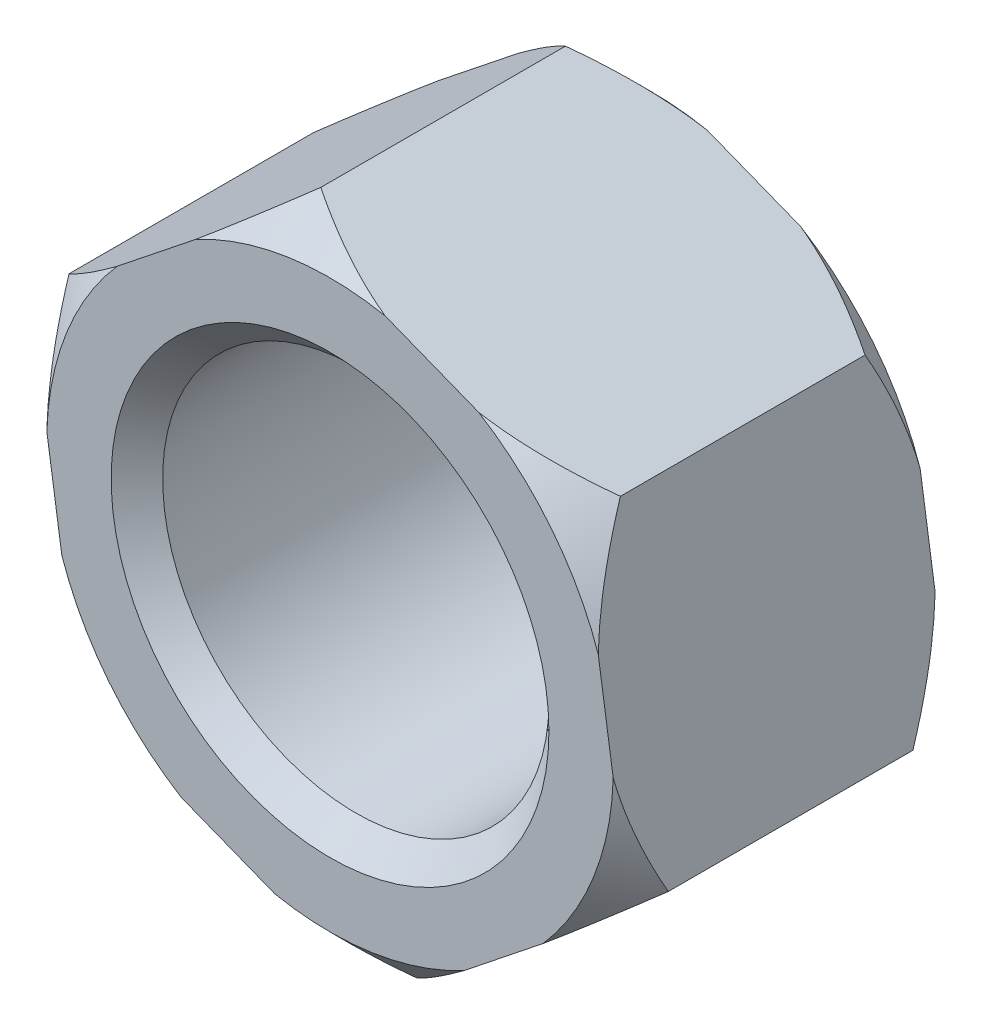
ISO-10303-21;
HEADER;
FILE_DESCRIPTION(('STEP AP214'),'2;1');
FILE_NAME('part.step','',(''),(''),'','','');
FILE_SCHEMA(('AUTOMOTIVE_DESIGN { 1 0 10303 214 1 1 1 1 }'));
ENDSEC;
DATA;
#1=APPLICATION_CONTEXT('core data for automotive mechanical design processes');
#2=APPLICATION_PROTOCOL_DEFINITION('international standard','automotive_design',2000,#1);
#3=PRODUCT_CONTEXT('',#1,'mechanical');
#4=PRODUCT('Part','Part','',(#3));
#5=PRODUCT_RELATED_PRODUCT_CATEGORY('part','',(#4));
#6=PRODUCT_DEFINITION_FORMATION('','',#4);
#7=PRODUCT_DEFINITION_CONTEXT('part definition',#1,'design');
#8=PRODUCT_DEFINITION('design','',#6,#7);
#9=PRODUCT_DEFINITION_SHAPE('','',#8);
#10=(LENGTH_UNIT() NAMED_UNIT(*) SI_UNIT(.MILLI.,.METRE.));
#11=(NAMED_UNIT(*) PLANE_ANGLE_UNIT() SI_UNIT($,.RADIAN.));
#12=(NAMED_UNIT(*) SI_UNIT($,.STERADIAN.) SOLID_ANGLE_UNIT());
#13=UNCERTAINTY_MEASURE_WITH_UNIT(LENGTH_MEASURE(1.E-05),#10,'distance_accuracy_value','');
#14=(GEOMETRIC_REPRESENTATION_CONTEXT(3) GLOBAL_UNCERTAINTY_ASSIGNED_CONTEXT((#13)) GLOBAL_UNIT_ASSIGNED_CONTEXT((#10,
#11,#12)) REPRESENTATION_CONTEXT('',''));
#15=CARTESIAN_POINT('',(0.,0.,0.));
#16=DIRECTION('',(0.,0.,1.));
#17=DIRECTION('',(1.,0.,0.));
#18=AXIS2_PLACEMENT_3D('',#15,#16,#17);
#19=CARTESIAN_POINT('',(0.,0.,2.5));
#20=DIRECTION('',(0.,0.,-1.));
#21=DIRECTION('',(-1.,0.,0.));
#22=AXIS2_PLACEMENT_3D('',#19,#20,#21);
#23=CONICAL_SURFACE('',#22,2.2,0.785398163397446);
#24=CARTESIAN_POINT('',(-1.88289645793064,3.06565975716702,1.10228283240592));
#25=CARTESIAN_POINT('',(-1.82617036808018,3.04337864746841,1.15095201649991));
#26=CARTESIAN_POINT('',(-1.76919378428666,3.02099914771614,1.19928580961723));
#27=CARTESIAN_POINT('',(-1.65464860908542,2.97600761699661,1.29515216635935));
#28=CARTESIAN_POINT('',(-1.59707994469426,2.95339555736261,1.34268462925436));
#29=CARTESIAN_POINT('',(-1.4229585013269,2.88500341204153,1.48420109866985));
#30=CARTESIAN_POINT('',(-1.30539281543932,2.83882547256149,1.57675580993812));
#31=CARTESIAN_POINT('',(-1.06224017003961,2.74331896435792,1.7597462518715));
#32=CARTESIAN_POINT('',(-0.936517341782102,2.69393702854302,1.84997725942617));
#33=CARTESIAN_POINT('',(-0.744088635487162,2.61835408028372,1.97849847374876));
#34=CARTESIAN_POINT('',(-0.679347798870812,2.59292490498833,2.02017674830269));
#35=CARTESIAN_POINT('',(-0.548356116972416,2.54147344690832,2.10068474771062));
#36=CARTESIAN_POINT('',(-0.482105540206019,2.51545126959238,2.13951497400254));
#37=CARTESIAN_POINT('',(-0.352290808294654,2.46446209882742,2.21115471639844));
#38=CARTESIAN_POINT('',(-0.288837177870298,2.43953851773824,2.24419234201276));
#39=CARTESIAN_POINT('',(-0.160309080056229,2.38905471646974,2.30637006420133));
#40=CARTESIAN_POINT('',(-0.0952343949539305,2.36349441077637,2.33550963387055));
#41=CARTESIAN_POINT('',(0.101642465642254,2.28616429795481,2.41526537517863));
#42=CARTESIAN_POINT('',(0.236160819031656,2.23332761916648,2.45883814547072));
#43=CARTESIAN_POINT('',(0.431182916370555,2.15672602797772,2.5014461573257));
#44=CARTESIAN_POINT('',(0.489631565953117,2.13376832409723,2.5116745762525));
#45=CARTESIAN_POINT('',(0.607133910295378,2.08761526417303,2.52679198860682));
#46=CARTESIAN_POINT('',(0.666187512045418,2.06441994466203,2.531681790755));
#47=CARTESIAN_POINT('',(0.784398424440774,2.01798857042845,2.5358525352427));
#48=CARTESIAN_POINT('',(0.843555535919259,1.99475259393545,2.53513996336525));
#49=CARTESIAN_POINT('',(0.961586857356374,1.94839176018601,2.52816469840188));
#50=CARTESIAN_POINT('',(1.0204610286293,1.92526691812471,2.52190126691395));
#51=CARTESIAN_POINT('',(1.15212266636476,1.87355231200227,2.50192366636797));
#52=CARTESIAN_POINT('',(1.22471728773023,1.84503829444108,2.48674063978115));
#53=CARTESIAN_POINT('',(1.36830335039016,1.78863996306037,2.44925065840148));
#54=CARTESIAN_POINT('',(1.43929377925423,1.76075604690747,2.42693933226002));
#55=CARTESIAN_POINT('',(1.58022190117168,1.7054017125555,2.3761351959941));
#56=CARTESIAN_POINT('',(1.65013782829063,1.67793984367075,2.34757367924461));
#57=CARTESIAN_POINT('',(1.78805340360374,1.62376878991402,2.2856203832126));
#58=CARTESIAN_POINT('',(1.85605333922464,1.59705949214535,2.25222933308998));
#59=CARTESIAN_POINT('',(1.99455733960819,1.54265731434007,2.17936971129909));
#60=CARTESIAN_POINT('',(2.06494586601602,1.5150098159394,2.13964975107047));
#61=CARTESIAN_POINT('',(2.20397747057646,1.46040040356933,2.05681563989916));
#62=CARTESIAN_POINT('',(2.27262013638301,1.43343865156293,2.01370069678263));
#63=CARTESIAN_POINT('',(2.40850196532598,1.38006642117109,1.92473222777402));
#64=CARTESIAN_POINT('',(2.47573854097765,1.35365695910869,1.8788741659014));
#65=CARTESIAN_POINT('',(2.60891600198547,1.30134696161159,1.78503329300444));
#66=CARTESIAN_POINT('',(2.67485679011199,1.27544646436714,1.73705032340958));
#67=CARTESIAN_POINT('',(2.80251401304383,1.22530472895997,1.64170881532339));
#68=CARTESIAN_POINT('',(2.86428195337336,1.20104326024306,1.59442959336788));
#69=CARTESIAN_POINT('',(2.98695966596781,1.15285739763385,1.4985999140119));
#70=CARTESIAN_POINT('',(3.04786940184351,1.12893301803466,1.45004940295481));
#71=CARTESIAN_POINT('',(3.16867429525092,1.08148276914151,1.35212114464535));
#72=CARTESIAN_POINT('',(3.2285728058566,1.05795558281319,1.3027481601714));
#73=CARTESIAN_POINT('',(3.34772500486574,1.01115448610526,1.20313047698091));
#74=CARTESIAN_POINT('',(3.40697878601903,0.987880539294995,1.15288590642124));
#75=CARTESIAN_POINT('',(3.46596286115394,0.964712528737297,1.10228283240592));
#76=B_SPLINE_CURVE_WITH_KNOTS('',3,(#24,#25,#26,#27,#28,#29,#30,#31,#32,#33,#34,#35,#36,#37,#38,
#39,#40,#41,#42,#43,#44,#45,#46,#47,#48,#49,#50,#51,#52,#53,#54,#55,#56,#57,#58,#59,#60,#61,#62,
#63,#64,#65,#66,#67,#68,#69,#70,#71,#72,#73,#74,#75),.UNSPECIFIED.,.F.,.F.,(4,2,2,2,2,2,2,2,2,2,
2,2,2,2,2,2,2,2,2,2,2,2,2,2,2,4),(0.,0.233980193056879,0.467989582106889,0.93767374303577,
1.42471596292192,1.66792488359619,1.9110908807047,2.13823842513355,2.36541664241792,
2.81589617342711,3.00657962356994,3.19723418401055,3.38766805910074,3.57812727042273,
3.81609719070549,4.05421332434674,4.29509175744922,4.53593386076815,4.79208348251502,
5.04829305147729,5.30493867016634,5.56160347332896,5.80603012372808,6.05046710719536,
6.2937931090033,6.53708363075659),.UNSPECIFIED.);
#77=CARTESIAN_POINT('',(-0.371935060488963,2.47217804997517,2.20000000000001));
#78=VERTEX_POINT('',#77);
#79=CARTESIAN_POINT('',(0.428054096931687,2.1579549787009,2.5));
#80=VERTEX_POINT('',#79);
#81=EDGE_CURVE('E165',#78,#80,#76,.T.);
#82=ORIENTED_EDGE('',*,*,#81,.F.);
#83=CARTESIAN_POINT('',(-3.83789792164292,-0.290297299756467,0.85113874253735));
#84=CARTESIAN_POINT('',(-3.7942238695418,-0.255487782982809,0.897311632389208));
#85=CARTESIAN_POINT('',(-3.75040408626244,-0.220562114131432,0.943258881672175));
#86=CARTESIAN_POINT('',(-3.66242946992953,-0.150443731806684,1.03462910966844));
#87=CARTESIAN_POINT('',(-3.61827462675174,-0.11525101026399,1.08005207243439));
#88=CARTESIAN_POINT('',(-3.48514435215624,-0.00914222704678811,1.21552440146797));
#89=CARTESIAN_POINT('',(-3.39560320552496,0.062224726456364,1.30467090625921));
#90=CARTESIAN_POINT('',(-3.21251630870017,0.208150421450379,1.48168085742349));
#91=CARTESIAN_POINT('',(-3.1189257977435,0.282744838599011,1.56946891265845));
#92=CARTESIAN_POINT('',(-2.92909902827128,0.434042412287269,1.74017902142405));
#93=CARTESIAN_POINT('',(-2.83286402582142,0.510744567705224,1.82310332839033));
#94=CARTESIAN_POINT('',(-2.66995305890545,0.640589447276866,1.95502254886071));
#95=CARTESIAN_POINT('',(-2.60427176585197,0.692939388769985,2.00601738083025));
#96=CARTESIAN_POINT('',(-2.47105930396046,0.799113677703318,2.10387791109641));
#97=CARTESIAN_POINT('',(-2.403528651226,0.852937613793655,2.15074474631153));
#98=CARTESIAN_POINT('',(-2.2666401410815,0.962041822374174,2.23880350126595));
#99=CARTESIAN_POINT('',(-2.19729307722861,1.01731349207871,2.28002255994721));
#100=CARTESIAN_POINT('',(-2.05624769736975,1.12973084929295,2.35527298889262));
#101=CARTESIAN_POINT('',(-1.98455085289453,1.18687536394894,2.38930876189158));
#102=CARTESIAN_POINT('',(-1.86250167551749,1.28415218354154,2.43849664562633));
#103=CARTESIAN_POINT('',(-1.8127777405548,1.32378363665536,2.45619189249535));
#104=CARTESIAN_POINT('',(-1.71241595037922,1.40377496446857,2.48661543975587));
#105=CARTESIAN_POINT('',(-1.66177847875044,1.44413453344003,2.49934577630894));
#106=CARTESIAN_POINT('',(-1.55997030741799,1.52527866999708,2.51920697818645));
#107=CARTESIAN_POINT('',(-1.50880147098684,1.56606175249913,2.52635324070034));
#108=CARTESIAN_POINT('',(-1.40616516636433,1.64786593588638,2.53471121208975));
#109=CARTESIAN_POINT('',(-1.35469770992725,1.68888702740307,2.53592315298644));
#110=CARTESIAN_POINT('',(-1.25183585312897,1.77087098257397,2.53234016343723));
#111=CARTESIAN_POINT('',(-1.20044159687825,1.81183373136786,2.52753857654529));
#112=CARTESIAN_POINT('',(-1.09818462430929,1.89333557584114,2.51219054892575));
#113=CARTESIAN_POINT('',(-1.04732195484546,1.93387463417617,2.50164360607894));
#114=CARTESIAN_POINT('',(-0.946264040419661,2.01442079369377,2.47530068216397));
#115=CARTESIAN_POINT('',(-0.896071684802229,2.05442559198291,2.45948681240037));
#116=CARTESIAN_POINT('',(-0.79671720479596,2.13361406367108,2.42330050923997));
#117=CARTESIAN_POINT('',(-0.747555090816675,2.17279772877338,2.40292802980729));
#118=CARTESIAN_POINT('',(-0.584685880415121,2.30260932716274,2.32824516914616));
#119=CARTESIAN_POINT('',(-0.473417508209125,2.39129352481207,2.26524020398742));
#120=CARTESIAN_POINT('',(-0.256198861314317,2.56442323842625,2.12562129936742));
#121=CARTESIAN_POINT('',(-0.150260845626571,2.64885898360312,2.04897767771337));
#122=CARTESIAN_POINT('',(0.0581089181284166,2.81493587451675,1.8864504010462));
#123=CARTESIAN_POINT('',(0.160512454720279,2.89655453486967,1.80050833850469));
#124=CARTESIAN_POINT('',(0.362041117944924,3.05717886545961,1.62287024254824));
#125=CARTESIAN_POINT('',(0.461169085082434,3.13618679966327,1.53117940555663));
#126=CARTESIAN_POINT('',(0.65837068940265,3.29336233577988,1.3425298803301));
#127=CARTESIAN_POINT('',(0.756412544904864,3.37150460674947,1.245517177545));
#128=CARTESIAN_POINT('',(0.901532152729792,3.48716924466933,1.09837217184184));
#129=CARTESIAN_POINT('',(0.949303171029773,3.52524416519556,1.04934897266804));
#130=CARTESIAN_POINT('',(1.04444817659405,3.60107756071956,0.950684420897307));
#131=CARTESIAN_POINT('',(1.09182218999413,3.63883605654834,0.901043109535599));
#132=CARTESIAN_POINT('',(1.13902633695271,3.6764591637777,0.85113874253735));
#133=B_SPLINE_CURVE_WITH_KNOTS('',3,(#83,#84,#85,#86,#87,#88,#89,#90,#91,#92,#93,#94,#95,#96,
#97,#98,#99,#100,#101,#102,#103,#104,#105,#106,#107,#108,#109,#110,#111,#112,#113,#114,#115,
#116,#117,#118,#119,#120,#121,#122,#123,#124,#125,#126,#127,#128,#129,#130,#131,#132),
.UNSPECIFIED.,.F.,.F.,(4,2,2,2,2,2,2,2,2,2,2,2,2,2,2,2,2,2,2,2,2,2,2,2,4),(0.,0.217391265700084,
0.434789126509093,0.870083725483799,1.31528638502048,1.76028112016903,2.05497608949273,
2.34958963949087,2.64273374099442,2.93569764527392,3.13353668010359,3.33129449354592,
3.52850507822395,3.72570795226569,3.92312930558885,4.12056791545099,4.31868406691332,
4.51680221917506,4.982311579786,5.44884671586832,5.91850422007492,6.3877431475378,
6.86325142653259,7.09822816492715,7.33318931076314),.UNSPECIFIED.);
#134=CARTESIAN_POINT('',(-1.04405480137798,1.93647865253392,2.5));
#135=VERTEX_POINT('',#134);
#136=EDGE_CURVE('E37',#135,#78,#133,.T.);
#137=ORIENTED_EDGE('',*,*,#136,.F.);
#138=CARTESIAN_POINT('',(0.,0.,2.5));
#139=DIRECTION('',(0.,0.,1.));
#140=DIRECTION('',(1.,0.,0.));
#141=AXIS2_PLACEMENT_3D('',#138,#139,#140);
#142=CIRCLE('',#141,2.2);
#143=EDGE_CURVE('E53',#80,#135,#142,.T.);
#144=ORIENTED_EDGE('',*,*,#143,.F.);
#145=EDGE_LOOP('',(#82,#137,#144));
#146=FACE_BOUND('',#145,.T.);
#147=ADVANCED_FACE('F33',(#146),#23,.T.);
#148=CARTESIAN_POINT('',(0.,0.,0.299999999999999));
#149=DIRECTION('',(0.,0.,1.));
#150=DIRECTION('',(1.,0.,0.));
#151=AXIS2_PLACEMENT_3D('',#148,#149,#150);
#152=CONICAL_SURFACE('',#151,2.5,0.78539816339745);
#153=CARTESIAN_POINT('',(3.46596286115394,0.964712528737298,1.39771716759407));
#154=CARTESIAN_POINT('',(3.40923677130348,0.986993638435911,1.34904798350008));
#155=CARTESIAN_POINT('',(3.35226018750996,1.00937313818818,1.30071419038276));
#156=CARTESIAN_POINT('',(3.23771501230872,1.05436466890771,1.20484783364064));
#157=CARTESIAN_POINT('',(3.18014634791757,1.07697672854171,1.15731537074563));
#158=CARTESIAN_POINT('',(3.0060249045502,1.14536887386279,1.01579890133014));
#159=CARTESIAN_POINT('',(2.88845921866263,1.19154681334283,0.923244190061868));
#160=CARTESIAN_POINT('',(2.64530657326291,1.2870533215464,0.740253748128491));
#161=CARTESIAN_POINT('',(2.5195837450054,1.3364352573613,0.650022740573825));
#162=CARTESIAN_POINT('',(2.32715503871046,1.41201820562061,0.521501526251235));
#163=CARTESIAN_POINT('',(2.26241420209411,1.43744738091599,0.479823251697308));
#164=CARTESIAN_POINT('',(2.13142252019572,1.488898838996,0.399315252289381));
#165=CARTESIAN_POINT('',(2.06517194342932,1.51492101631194,0.360485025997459));
#166=CARTESIAN_POINT('',(1.93535721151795,1.5659101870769,0.288845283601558));
#167=CARTESIAN_POINT('',(1.8719035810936,1.59083376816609,0.255807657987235));
#168=CARTESIAN_POINT('',(1.74337548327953,1.64131756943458,0.193629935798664));
#169=CARTESIAN_POINT('',(1.67830079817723,1.66687787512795,0.164490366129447));
#170=CARTESIAN_POINT('',(1.48142393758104,1.74420798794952,0.0847346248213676));
#171=CARTESIAN_POINT('',(1.34690558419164,1.79704466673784,0.0411618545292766));
#172=CARTESIAN_POINT('',(1.15188348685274,1.8736462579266,-0.00144615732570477));
#173=CARTESIAN_POINT('',(1.09343483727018,1.89660396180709,-0.0116745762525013));
#174=CARTESIAN_POINT('',(0.975932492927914,1.9427570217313,-0.0267919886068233));
#175=CARTESIAN_POINT('',(0.916878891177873,1.9659523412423,-0.0316817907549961));
#176=CARTESIAN_POINT('',(0.798667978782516,2.01238371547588,-0.0358525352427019));
#177=CARTESIAN_POINT('',(0.739510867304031,2.03561969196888,-0.0351399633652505));
#178=CARTESIAN_POINT('',(0.621479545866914,2.08198052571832,-0.0281646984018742));
#179=CARTESIAN_POINT('',(0.562605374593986,2.10510536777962,-0.0219012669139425));
#180=CARTESIAN_POINT('',(0.430943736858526,2.15681997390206,-0.00192366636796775));
#181=CARTESIAN_POINT('',(0.358349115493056,2.18533399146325,0.0132593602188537));
#182=CARTESIAN_POINT('',(0.214763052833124,2.24173232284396,0.0507493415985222));
#183=CARTESIAN_POINT('',(0.143772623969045,2.26961623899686,0.0730606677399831));
#184=CARTESIAN_POINT('',(0.00284450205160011,2.32497057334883,0.123864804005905));
#185=CARTESIAN_POINT('',(-0.0670714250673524,2.35243244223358,0.152426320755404));
#186=CARTESIAN_POINT('',(-0.204987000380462,2.40660349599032,0.21437961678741));
#187=CARTESIAN_POINT('',(-0.272986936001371,2.43331279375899,0.247770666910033));
#188=CARTESIAN_POINT('',(-0.411490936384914,2.48771497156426,0.320630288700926));
#189=CARTESIAN_POINT('',(-0.481879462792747,2.51536246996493,0.360350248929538));
#190=CARTESIAN_POINT('',(-0.620911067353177,2.569971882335,0.443184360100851));
#191=CARTESIAN_POINT('',(-0.68955373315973,2.5969336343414,0.486299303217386));
#192=CARTESIAN_POINT('',(-0.825435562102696,2.65030586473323,0.575267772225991));
#193=CARTESIAN_POINT('',(-0.892672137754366,2.67671532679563,0.621125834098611));
#194=CARTESIAN_POINT('',(-1.02584959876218,2.72902532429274,0.714966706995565));
#195=CARTESIAN_POINT('',(-1.0917903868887,2.75492582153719,0.762949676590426));
#196=CARTESIAN_POINT('',(-1.21944760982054,2.80506755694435,0.858291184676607));
#197=CARTESIAN_POINT('',(-1.28121555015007,2.82932902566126,0.905570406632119));
#198=CARTESIAN_POINT('',(-1.40389326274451,2.87751488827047,1.00140008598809));
#199=CARTESIAN_POINT('',(-1.46480299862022,2.90143926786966,1.04995059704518));
#200=CARTESIAN_POINT('',(-1.58560789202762,2.94888951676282,1.14787885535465));
#201=CARTESIAN_POINT('',(-1.6455064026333,2.97241670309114,1.19725183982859));
#202=CARTESIAN_POINT('',(-1.76465860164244,3.01921779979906,1.29686952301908));
#203=CARTESIAN_POINT('',(-1.82391238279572,3.04249174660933,1.34711409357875));
#204=CARTESIAN_POINT('',(-1.88289645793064,3.06565975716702,1.39771716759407));
#205=B_SPLINE_CURVE_WITH_KNOTS('',3,(#153,#154,#155,#156,#157,#158,#159,#160,#161,#162,#163,
#164,#165,#166,#167,#168,#169,#170,#171,#172,#173,#174,#175,#176,#177,#178,#179,#180,#181,#182,
#183,#184,#185,#186,#187,#188,#189,#190,#191,#192,#193,#194,#195,#196,#197,#198,#199,#200,#201,
#202,#203,#204),.UNSPECIFIED.,.F.,.F.,(4,2,2,2,2,2,2,2,2,2,2,2,2,2,2,2,2,2,2,2,2,2,2,2,2,4),(0.,
0.233980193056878,0.467989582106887,0.937673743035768,1.42471596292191,1.66792488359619,
1.9110908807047,2.13823842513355,2.36541664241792,2.81589617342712,3.00657962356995,
3.19723418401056,3.38766805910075,3.57812727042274,3.8160971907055,4.05421332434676,
4.29509175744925,4.53593386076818,4.79208348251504,5.04829305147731,5.30493867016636,
5.56160347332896,5.80603012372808,6.05046710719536,6.29379310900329,6.53708363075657),.UNSPECIFIED.);
#206=CARTESIAN_POINT('',(1.95500146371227,1.55819423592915,0.300000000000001));
#207=VERTEX_POINT('',#206);
#208=CARTESIAN_POINT('',(1.15501230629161,1.87241730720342,0.));
#209=VERTEX_POINT('',#208);
#210=EDGE_CURVE('E381',#207,#209,#205,.T.);
#211=ORIENTED_EDGE('',*,*,#210,.F.);
#212=CARTESIAN_POINT('',(2.55425814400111,-2.42494521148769,1.3220156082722));
#213=CARTESIAN_POINT('',(2.54506981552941,-2.36387222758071,1.27331100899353));
#214=CARTESIAN_POINT('',(2.53583792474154,-2.30250969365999,1.22497305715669));
#215=CARTESIAN_POINT('',(2.51727029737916,-2.17909438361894,1.1291869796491));
#216=CARTESIAN_POINT('',(2.50793454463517,-2.11704150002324,1.08173899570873));
#217=CARTESIAN_POINT('',(2.48910007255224,-1.9918525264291,0.987678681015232));
#218=CARTESIAN_POINT('',(2.47960078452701,-1.92871265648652,0.941071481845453));
#219=CARTESIAN_POINT('',(2.46046478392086,-1.80151948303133,0.849153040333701));
#220=CARTESIAN_POINT('',(2.45082807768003,-1.73746622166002,0.803841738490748));
#221=CARTESIAN_POINT('',(2.43092571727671,-1.60517920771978,0.712643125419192));
#222=CARTESIAN_POINT('',(2.42065215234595,-1.53689287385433,0.66683352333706));
#223=CARTESIAN_POINT('',(2.39990022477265,-1.3989589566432,0.577362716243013));
#224=CARTESIAN_POINT('',(2.38942187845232,-1.32931148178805,0.533701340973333));
#225=CARTESIAN_POINT('',(2.3682451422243,-1.18855394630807,0.449145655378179));
#226=CARTESIAN_POINT('',(2.35754718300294,-1.11744674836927,0.40824649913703));
#227=CARTESIAN_POINT('',(2.33588007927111,-0.973429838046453,0.329848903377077));
#228=CARTESIAN_POINT('',(2.32491100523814,-0.900520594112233,0.292349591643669));
#229=CARTESIAN_POINT('',(2.30378096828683,-0.760073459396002,0.225202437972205));
#230=CARTESIAN_POINT('',(2.29364906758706,-0.692728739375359,0.19514439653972));
#231=CARTESIAN_POINT('',(2.2731212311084,-0.556284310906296,0.139348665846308));
#232=CARTESIAN_POINT('',(2.2627252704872,-0.487184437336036,0.113611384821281));
#233=CARTESIAN_POINT('',(2.24178823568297,-0.348020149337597,0.0676775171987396));
#234=CARTESIAN_POINT('',(2.23124999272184,-0.277974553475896,0.0474234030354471));
#235=CARTESIAN_POINT('',(2.20995458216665,-0.136428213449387,0.0130729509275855));
#236=CARTESIAN_POINT('',(2.19919750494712,-0.0649280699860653,-0.00102587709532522));
#237=CARTESIAN_POINT('',(2.17731939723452,0.080491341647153,-0.0224297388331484));
#238=CARTESIAN_POINT('',(2.16619534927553,0.154430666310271,-0.0295984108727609));
#239=CARTESIAN_POINT('',(2.14389682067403,0.302644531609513,-0.0361413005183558));
#240=CARTESIAN_POINT('',(2.13272234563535,0.376919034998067,-0.0355163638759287));
#241=CARTESIAN_POINT('',(2.11041491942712,0.525192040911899,-0.0265096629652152));
#242=CARTESIAN_POINT('',(2.09928215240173,0.59918931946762,-0.0181076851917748));
#243=CARTESIAN_POINT('',(2.07719017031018,0.746030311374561,0.00587897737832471));
#244=CARTESIAN_POINT('',(2.06623100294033,0.818873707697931,0.0214656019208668));
#245=CARTESIAN_POINT('',(2.04148052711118,0.983385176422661,0.0641816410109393));
#246=CARTESIAN_POINT('',(2.02776703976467,1.07453598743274,0.0933306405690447));
#247=CARTESIAN_POINT('',(2.00078289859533,1.25389418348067,0.159711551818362));
#248=CARTESIAN_POINT('',(1.98751250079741,1.34209986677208,0.196948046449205));
#249=CARTESIAN_POINT('',(1.96129530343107,1.51636034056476,0.277872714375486));
#250=CARTESIAN_POINT('',(1.94835182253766,1.60239307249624,0.321608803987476));
#251=CARTESIAN_POINT('',(1.92284798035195,1.7719120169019,0.41377070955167));
#252=CARTESIAN_POINT('',(1.91028753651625,1.85539877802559,0.462195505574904));
#253=CARTESIAN_POINT('',(1.88281035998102,2.0380340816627,0.573446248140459));
#254=CARTESIAN_POINT('',(1.86797045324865,2.13667197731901,0.637124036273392));
#255=CARTESIAN_POINT('',(1.83866859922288,2.33143554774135,0.768318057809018));
#256=CARTESIAN_POINT('',(1.82420676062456,2.42756050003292,0.835835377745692));
#257=CARTESIAN_POINT('',(1.79593414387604,2.615482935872,0.972039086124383));
#258=CARTESIAN_POINT('',(1.78211608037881,2.70732884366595,1.04065756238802));
#259=CARTESIAN_POINT('',(1.75472830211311,2.88936993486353,1.17993948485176));
#260=CARTESIAN_POINT('',(1.74115838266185,2.97956647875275,1.2506011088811));
#261=CARTESIAN_POINT('',(1.72767984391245,3.0691556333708,1.3220156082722));
#262=B_SPLINE_CURVE_WITH_KNOTS('',3,(#212,#213,#214,#215,#216,#217,#218,#219,#220,#221,#222,
#223,#224,#225,#226,#227,#228,#229,#230,#231,#232,#233,#234,#235,#236,#237,#238,#239,#240,#241,
#242,#243,#244,#245,#246,#247,#248,#249,#250,#251,#252,#253,#254,#255,#256,#257,#258,#259,#260,
#261),.UNSPECIFIED.,.F.,.F.,(4,2,2,2,2,2,2,2,2,2,2,2,2,2,2,2,2,2,2,2,2,2,2,2,4),(0.,
0.235965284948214,0.47196783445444,0.709108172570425,0.946237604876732,1.1948094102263,
1.44336148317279,1.69146552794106,1.93950574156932,2.16270928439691,2.38593390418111,
2.60671677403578,2.82741024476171,3.05236279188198,3.27729092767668,3.50280532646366,
3.72838064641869,4.01790124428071,4.30758633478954,4.59952399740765,4.89139829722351,
5.24629502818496,5.60129269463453,5.94769302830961,6.29379341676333),.UNSPECIFIED.);
#263=CARTESIAN_POINT('',(2.08287088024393,0.708271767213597,0.));
#264=VERTEX_POINT('',#263);
#265=EDGE_CURVE('E225',#264,#207,#262,.T.);
#266=ORIENTED_EDGE('',*,*,#265,.F.);
#267=CARTESIAN_POINT('',(0.,0.,0.));
#268=DIRECTION('',(0.,0.,1.));
#269=DIRECTION('',(1.,0.,0.));
#270=AXIS2_PLACEMENT_3D('',#267,#268,#269);
#271=CIRCLE('',#270,2.2);
#272=EDGE_CURVE('E189',#209,#264,#271,.F.);
#273=ORIENTED_EDGE('',*,*,#272,.F.);
#274=EDGE_LOOP('',(#211,#266,#273));
#275=FACE_BOUND('',#274,.T.);
#276=ADVANCED_FACE('F258',(#275),#152,.T.);
#277=CARTESIAN_POINT('',(1.15501230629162,1.87241730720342,2.5));
#278=VERTEX_POINT('',#277);
#279=CARTESIAN_POINT('',(1.95500146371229,1.55819423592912,2.2));
#280=VERTEX_POINT('',#279);
#281=EDGE_CURVE('E174',#278,#280,#76,.T.);
#282=ORIENTED_EDGE('',*,*,#281,.F.);
#283=CARTESIAN_POINT('',(2.08287088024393,0.7082717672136,2.5));
#284=VERTEX_POINT('',#283);
#285=EDGE_CURVE('E181',#284,#278,#142,.T.);
#286=ORIENTED_EDGE('',*,*,#285,.F.);
#287=CARTESIAN_POINT('',(1.72767984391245,3.0691556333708,1.17798439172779));
#288=CARTESIAN_POINT('',(1.73686817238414,3.00808264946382,1.22668899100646));
#289=CARTESIAN_POINT('',(1.74610006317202,2.9467201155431,1.2750269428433));
#290=CARTESIAN_POINT('',(1.76466769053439,2.82330480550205,1.37081302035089));
#291=CARTESIAN_POINT('',(1.77400344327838,2.76125192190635,1.41826100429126));
#292=CARTESIAN_POINT('',(1.79283791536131,2.63606294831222,1.51232131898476));
#293=CARTESIAN_POINT('',(1.80233720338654,2.57292307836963,1.55892851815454));
#294=CARTESIAN_POINT('',(1.82147320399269,2.44572990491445,1.65084695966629));
#295=CARTESIAN_POINT('',(1.83110991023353,2.38167664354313,1.69615826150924));
#296=CARTESIAN_POINT('',(1.85101227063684,2.24938962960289,1.7873568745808));
#297=CARTESIAN_POINT('',(1.8612858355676,2.18110329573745,1.83316647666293));
#298=CARTESIAN_POINT('',(1.88203776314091,2.04316937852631,1.92263728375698));
#299=CARTESIAN_POINT('',(1.89251610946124,1.97352190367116,1.96629865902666));
#300=CARTESIAN_POINT('',(1.91369284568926,1.83276436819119,2.05085434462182));
#301=CARTESIAN_POINT('',(1.92439080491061,1.76165717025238,2.09175350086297));
#302=CARTESIAN_POINT('',(1.94605790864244,1.61764025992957,2.17015109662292));
#303=CARTESIAN_POINT('',(1.95702698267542,1.54473101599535,2.20765040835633));
#304=CARTESIAN_POINT('',(1.97815701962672,1.40428388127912,2.27479756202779));
#305=CARTESIAN_POINT('',(1.98828892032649,1.33693916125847,2.30485560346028));
#306=CARTESIAN_POINT('',(2.00881675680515,1.20049473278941,2.36065133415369));
#307=CARTESIAN_POINT('',(2.01921271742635,1.13139485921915,2.38638861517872));
#308=CARTESIAN_POINT('',(2.04014975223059,0.992230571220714,2.43232248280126));
#309=CARTESIAN_POINT('',(2.05068799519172,0.922184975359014,2.45257659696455));
#310=CARTESIAN_POINT('',(2.07198340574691,0.780638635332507,2.48692704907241));
#311=CARTESIAN_POINT('',(2.08274048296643,0.709138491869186,2.50102587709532));
#312=CARTESIAN_POINT('',(2.10461859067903,0.563719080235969,2.52242973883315));
#313=CARTESIAN_POINT('',(2.11574263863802,0.489779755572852,2.52959841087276));
#314=CARTESIAN_POINT('',(2.13804116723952,0.341565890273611,2.53614130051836));
#315=CARTESIAN_POINT('',(2.1492156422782,0.267291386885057,2.53551636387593));
#316=CARTESIAN_POINT('',(2.17152306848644,0.119018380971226,2.52650966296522));
#317=CARTESIAN_POINT('',(2.18265583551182,0.0450211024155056,2.51810768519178));
#318=CARTESIAN_POINT('',(2.20474781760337,-0.101819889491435,2.49412102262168));
#319=CARTESIAN_POINT('',(2.21570698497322,-0.174663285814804,2.47853439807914));
#320=CARTESIAN_POINT('',(2.24045746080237,-0.339174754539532,2.43581835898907));
#321=CARTESIAN_POINT('',(2.25417094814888,-0.430325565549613,2.40666935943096));
#322=CARTESIAN_POINT('',(2.28115508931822,-0.609683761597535,2.34028844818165));
#323=CARTESIAN_POINT('',(2.29442548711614,-0.697889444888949,2.3030519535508));
#324=CARTESIAN_POINT('',(2.32064268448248,-0.87214991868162,2.22212728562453));
#325=CARTESIAN_POINT('',(2.33358616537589,-0.958182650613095,2.17839119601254));
#326=CARTESIAN_POINT('',(2.3590900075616,-1.12770159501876,2.08622929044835));
#327=CARTESIAN_POINT('',(2.3716504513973,-1.21118835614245,2.03780449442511));
#328=CARTESIAN_POINT('',(2.39912762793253,-1.39382365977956,1.92655375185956));
#329=CARTESIAN_POINT('',(2.4139675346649,-1.49246155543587,1.86287596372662));
#330=CARTESIAN_POINT('',(2.44326938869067,-1.68722512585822,1.73168194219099));
#331=CARTESIAN_POINT('',(2.45773122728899,-1.78335007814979,1.66416462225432));
#332=CARTESIAN_POINT('',(2.48600384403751,-1.97127251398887,1.52796091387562));
#333=CARTESIAN_POINT('',(2.49982190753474,-2.06311842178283,1.45934243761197));
#334=CARTESIAN_POINT('',(2.52720968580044,-2.24515951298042,1.32006051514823));
#335=CARTESIAN_POINT('',(2.5407796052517,-2.33535605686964,1.24939889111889));
#336=CARTESIAN_POINT('',(2.55425814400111,-2.42494521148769,1.17798439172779));
#337=B_SPLINE_CURVE_WITH_KNOTS('',3,(#287,#288,#289,#290,#291,#292,#293,#294,#295,#296,#297,
#298,#299,#300,#301,#302,#303,#304,#305,#306,#307,#308,#309,#310,#311,#312,#313,#314,#315,#316,
#317,#318,#319,#320,#321,#322,#323,#324,#325,#326,#327,#328,#329,#330,#331,#332,#333,#334,#335,
#336),.UNSPECIFIED.,.F.,.F.,(4,2,2,2,2,2,2,2,2,2,2,2,2,2,2,2,2,2,2,2,2,2,2,2,4),(0.,
0.235965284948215,0.47196783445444,0.709108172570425,0.946237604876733,1.1948094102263,
1.44336148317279,1.69146552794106,1.93950574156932,2.16270928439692,2.38593390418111,
2.60671677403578,2.82741024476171,3.05236279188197,3.27729092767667,3.50280532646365,
3.72838064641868,4.0179012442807,4.30758633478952,4.59952399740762,4.89139829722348,
5.24629502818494,5.60129269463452,5.94769302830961,6.29379341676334),.UNSPECIFIED.);
#338=EDGE_CURVE('E219',#280,#284,#337,.T.);
#339=ORIENTED_EDGE('',*,*,#338,.F.);
#340=EDGE_LOOP('',(#282,#286,#339));
#341=FACE_BOUND('',#340,.T.);
#342=ADVANCED_FACE('F406',(#341),#23,.T.);
#343=CARTESIAN_POINT('',(2.32693652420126,-0.913983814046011,0.300000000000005));
#344=VERTEX_POINT('',#343);
#345=CARTESIAN_POINT('',(2.19906710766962,-0.0640613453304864,0.));
#346=VERTEX_POINT('',#345);
#347=EDGE_CURVE('E220',#344,#346,#262,.T.);
#348=ORIENTED_EDGE('',*,*,#347,.F.);
#349=CARTESIAN_POINT('',(-1.13902633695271,-3.6764591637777,1.64886125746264));
#350=CARTESIAN_POINT('',(-1.09535228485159,-3.64164964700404,1.60268836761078));
#351=CARTESIAN_POINT('',(-1.05153250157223,-3.60672397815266,1.55674111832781));
#352=CARTESIAN_POINT('',(-0.963557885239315,-3.53660559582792,1.46537089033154));
#353=CARTESIAN_POINT('',(-0.919403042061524,-3.50141287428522,1.41994792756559));
#354=CARTESIAN_POINT('',(-0.786272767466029,-3.39530409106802,1.28447559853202));
#355=CARTESIAN_POINT('',(-0.696731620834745,-3.32393713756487,1.19532909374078));
#356=CARTESIAN_POINT('',(-0.513644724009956,-3.17801144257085,1.0183191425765));
#357=CARTESIAN_POINT('',(-0.420054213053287,-3.10341702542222,0.930531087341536));
#358=CARTESIAN_POINT('',(-0.230227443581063,-2.95211945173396,0.75982097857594));
#359=CARTESIAN_POINT('',(-0.133992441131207,-2.875417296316,0.67689667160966));
#360=CARTESIAN_POINT('',(0.0289185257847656,-2.74557241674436,0.544977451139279));
#361=CARTESIAN_POINT('',(0.0945998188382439,-2.69322247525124,0.493982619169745));
#362=CARTESIAN_POINT('',(0.227812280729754,-2.58704818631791,0.396122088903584));
#363=CARTESIAN_POINT('',(0.295342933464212,-2.53322425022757,0.349255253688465));
#364=CARTESIAN_POINT('',(0.432231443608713,-2.42412004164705,0.261196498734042));
#365=CARTESIAN_POINT('',(0.501578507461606,-2.36884837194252,0.219977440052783));
#366=CARTESIAN_POINT('',(0.64262388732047,-2.25643101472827,0.144727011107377));
#367=CARTESIAN_POINT('',(0.714320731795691,-2.19928650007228,0.110691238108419));
#368=CARTESIAN_POINT('',(0.836369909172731,-2.10200968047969,0.0615033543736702));
#369=CARTESIAN_POINT('',(0.88609384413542,-2.06237822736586,0.0438081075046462));
#370=CARTESIAN_POINT('',(0.986455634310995,-1.98238689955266,0.0133845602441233));
#371=CARTESIAN_POINT('',(1.03709310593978,-1.9420273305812,0.000654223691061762));
#372=CARTESIAN_POINT('',(1.13890127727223,-1.86088319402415,-0.0192069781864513));
#373=CARTESIAN_POINT('',(1.19007011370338,-1.82010011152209,-0.0263532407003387));
#374=CARTESIAN_POINT('',(1.29270641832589,-1.73829592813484,-0.0347112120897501));
#375=CARTESIAN_POINT('',(1.34417387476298,-1.69727483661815,-0.0359231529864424));
#376=CARTESIAN_POINT('',(1.44703573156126,-1.61529088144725,-0.0323401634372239));
#377=CARTESIAN_POINT('',(1.49842998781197,-1.57432813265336,-0.0275385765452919));
#378=CARTESIAN_POINT('',(1.60068696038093,-1.49282628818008,-0.0121905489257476));
#379=CARTESIAN_POINT('',(1.65154962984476,-1.45228722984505,-0.00164360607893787));
#380=CARTESIAN_POINT('',(1.75260754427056,-1.37174107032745,0.0246993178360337));
#381=CARTESIAN_POINT('',(1.80279989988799,-1.33173627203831,0.040513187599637));
#382=CARTESIAN_POINT('',(1.90215437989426,-1.25254780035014,0.0766994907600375));
#383=CARTESIAN_POINT('',(1.95131649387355,-1.21336413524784,0.0970719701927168));
#384=CARTESIAN_POINT('',(2.11418570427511,-1.08355253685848,0.171754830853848));
#385=CARTESIAN_POINT('',(2.22545407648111,-0.994868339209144,0.234759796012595));
#386=CARTESIAN_POINT('',(2.44267272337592,-0.821738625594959,0.374378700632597));
#387=CARTESIAN_POINT('',(2.54861073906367,-0.737302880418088,0.451022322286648));
#388=CARTESIAN_POINT('',(2.75698050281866,-0.571225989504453,0.613549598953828));
#389=CARTESIAN_POINT('',(2.85938403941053,-0.489607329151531,0.699491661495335));
#390=CARTESIAN_POINT('',(3.06091270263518,-0.328982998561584,0.877129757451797));
#391=CARTESIAN_POINT('',(3.16004066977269,-0.249975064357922,0.968820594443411));
#392=CARTESIAN_POINT('',(3.3572422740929,-0.0927995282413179,1.15747011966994));
#393=CARTESIAN_POINT('',(3.45528412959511,-0.0146572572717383,1.25448282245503));
#394=CARTESIAN_POINT('',(3.60040373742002,0.10100738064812,1.40162782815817));
#395=CARTESIAN_POINT('',(3.64817475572,0.139082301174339,1.45065102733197));
#396=CARTESIAN_POINT('',(3.74331976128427,0.214915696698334,1.54931557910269));
#397=CARTESIAN_POINT('',(3.79069377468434,0.252674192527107,1.59895689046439));
#398=CARTESIAN_POINT('',(3.83789792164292,0.290297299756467,1.64886125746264));
#399=B_SPLINE_CURVE_WITH_KNOTS('',3,(#349,#350,#351,#352,#353,#354,#355,#356,#357,#358,#359,
#360,#361,#362,#363,#364,#365,#366,#367,#368,#369,#370,#371,#372,#373,#374,#375,#376,#377,#378,
#379,#380,#381,#382,#383,#384,#385,#386,#387,#388,#389,#390,#391,#392,#393,#394,#395,#396,#397,
#398),.UNSPECIFIED.,.F.,.F.,(4,2,2,2,2,2,2,2,2,2,2,2,2,2,2,2,2,2,2,2,2,2,2,2,4),(0.,
0.217391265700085,0.434789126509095,0.870083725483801,1.31528638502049,1.76028112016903,
2.05497608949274,2.34958963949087,2.64273374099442,2.93569764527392,3.13353668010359,
3.33129449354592,3.52850507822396,3.7257079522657,3.92312930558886,4.120567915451,
4.31868406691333,4.51680221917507,4.98231157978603,5.44884671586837,5.91850422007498,
6.38774314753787,6.86325142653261,7.09822816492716,7.33318931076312),.UNSPECIFIED.);
#400=CARTESIAN_POINT('',(1.65481678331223,-1.44968321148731,0.));
#401=VERTEX_POINT('',#400);
#402=EDGE_CURVE('E290',#401,#344,#399,.T.);
#403=ORIENTED_EDGE('',*,*,#402,.F.);
#404=EDGE_CURVE('E367',#346,#401,#271,.F.);
#405=ORIENTED_EDGE('',*,*,#404,.F.);
#406=EDGE_LOOP('',(#348,#403,#405));
#407=FACE_BOUND('',#406,.T.);
#408=ADVANCED_FACE('F404',(#407),#152,.T.);
#409=CARTESIAN_POINT('',(2.19906710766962,-0.0640613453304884,2.5));
#410=VERTEX_POINT('',#409);
#411=CARTESIAN_POINT('',(2.32693652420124,-0.913983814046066,2.2));
#412=VERTEX_POINT('',#411);
#413=EDGE_CURVE('E216',#410,#412,#337,.T.);
#414=ORIENTED_EDGE('',*,*,#413,.F.);
#415=CARTESIAN_POINT('',(1.65481678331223,-1.44968321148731,2.5));
#416=VERTEX_POINT('',#415);
#417=EDGE_CURVE('E187',#416,#410,#142,.T.);
#418=ORIENTED_EDGE('',*,*,#417,.F.);
#419=CARTESIAN_POINT('',(3.83789792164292,0.290297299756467,0.85113874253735));
#420=CARTESIAN_POINT('',(3.7942238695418,0.255487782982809,0.897311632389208));
#421=CARTESIAN_POINT('',(3.75040408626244,0.220562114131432,0.943258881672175));
#422=CARTESIAN_POINT('',(3.66242946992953,0.150443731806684,1.03462910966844));
#423=CARTESIAN_POINT('',(3.61827462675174,0.11525101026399,1.08005207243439));
#424=CARTESIAN_POINT('',(3.48514435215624,0.00914222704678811,1.21552440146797));
#425=CARTESIAN_POINT('',(3.39560320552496,-0.062224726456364,1.30467090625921));
#426=CARTESIAN_POINT('',(3.21251630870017,-0.208150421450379,1.48168085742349));
#427=CARTESIAN_POINT('',(3.1189257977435,-0.282744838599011,1.56946891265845));
#428=CARTESIAN_POINT('',(2.92909902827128,-0.434042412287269,1.74017902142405));
#429=CARTESIAN_POINT('',(2.83286402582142,-0.510744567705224,1.82310332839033));
#430=CARTESIAN_POINT('',(2.66995305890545,-0.640589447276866,1.95502254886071));
#431=CARTESIAN_POINT('',(2.60427176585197,-0.692939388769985,2.00601738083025));
#432=CARTESIAN_POINT('',(2.47105930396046,-0.799113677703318,2.10387791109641));
#433=CARTESIAN_POINT('',(2.403528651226,-0.852937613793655,2.15074474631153));
#434=CARTESIAN_POINT('',(2.2666401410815,-0.962041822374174,2.23880350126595));
#435=CARTESIAN_POINT('',(2.19729307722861,-1.01731349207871,2.28002255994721));
#436=CARTESIAN_POINT('',(2.05624769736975,-1.12973084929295,2.35527298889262));
#437=CARTESIAN_POINT('',(1.98455085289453,-1.18687536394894,2.38930876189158));
#438=CARTESIAN_POINT('',(1.86250167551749,-1.28415218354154,2.43849664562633));
#439=CARTESIAN_POINT('',(1.8127777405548,-1.32378363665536,2.45619189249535));
#440=CARTESIAN_POINT('',(1.71241595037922,-1.40377496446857,2.48661543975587));
#441=CARTESIAN_POINT('',(1.66177847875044,-1.44413453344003,2.49934577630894));
#442=CARTESIAN_POINT('',(1.55997030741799,-1.52527866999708,2.51920697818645));
#443=CARTESIAN_POINT('',(1.50880147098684,-1.56606175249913,2.52635324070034));
#444=CARTESIAN_POINT('',(1.40616516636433,-1.64786593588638,2.53471121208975));
#445=CARTESIAN_POINT('',(1.35469770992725,-1.68888702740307,2.53592315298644));
#446=CARTESIAN_POINT('',(1.25183585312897,-1.77087098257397,2.53234016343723));
#447=CARTESIAN_POINT('',(1.20044159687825,-1.81183373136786,2.52753857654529));
#448=CARTESIAN_POINT('',(1.09818462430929,-1.89333557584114,2.51219054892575));
#449=CARTESIAN_POINT('',(1.04732195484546,-1.93387463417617,2.50164360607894));
#450=CARTESIAN_POINT('',(0.946264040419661,-2.01442079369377,2.47530068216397));
#451=CARTESIAN_POINT('',(0.896071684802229,-2.05442559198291,2.45948681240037));
#452=CARTESIAN_POINT('',(0.79671720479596,-2.13361406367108,2.42330050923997));
#453=CARTESIAN_POINT('',(0.747555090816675,-2.17279772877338,2.40292802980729));
#454=CARTESIAN_POINT('',(0.584685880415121,-2.30260932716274,2.32824516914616));
#455=CARTESIAN_POINT('',(0.473417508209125,-2.39129352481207,2.26524020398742));
#456=CARTESIAN_POINT('',(0.256198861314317,-2.56442323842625,2.12562129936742));
#457=CARTESIAN_POINT('',(0.150260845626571,-2.64885898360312,2.04897767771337));
#458=CARTESIAN_POINT('',(-0.0581089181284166,-2.81493587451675,1.8864504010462));
#459=CARTESIAN_POINT('',(-0.160512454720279,-2.89655453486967,1.80050833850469));
#460=CARTESIAN_POINT('',(-0.362041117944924,-3.05717886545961,1.62287024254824));
#461=CARTESIAN_POINT('',(-0.461169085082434,-3.13618679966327,1.53117940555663));
#462=CARTESIAN_POINT('',(-0.65837068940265,-3.29336233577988,1.3425298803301));
#463=CARTESIAN_POINT('',(-0.756412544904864,-3.37150460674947,1.245517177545));
#464=CARTESIAN_POINT('',(-0.901532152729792,-3.48716924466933,1.09837217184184));
#465=CARTESIAN_POINT('',(-0.949303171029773,-3.52524416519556,1.04934897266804));
#466=CARTESIAN_POINT('',(-1.04444817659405,-3.60107756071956,0.950684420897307));
#467=CARTESIAN_POINT('',(-1.09182218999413,-3.63883605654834,0.901043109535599));
#468=CARTESIAN_POINT('',(-1.13902633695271,-3.6764591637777,0.85113874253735));
#469=B_SPLINE_CURVE_WITH_KNOTS('',3,(#419,#420,#421,#422,#423,#424,#425,#426,#427,#428,#429,
#430,#431,#432,#433,#434,#435,#436,#437,#438,#439,#440,#441,#442,#443,#444,#445,#446,#447,#448,
#449,#450,#451,#452,#453,#454,#455,#456,#457,#458,#459,#460,#461,#462,#463,#464,#465,#466,#467,
#468),.UNSPECIFIED.,.F.,.F.,(4,2,2,2,2,2,2,2,2,2,2,2,2,2,2,2,2,2,2,2,2,2,2,2,4),(0.,
0.217391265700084,0.434789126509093,0.870083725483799,1.31528638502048,1.76028112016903,
2.05497608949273,2.34958963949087,2.64273374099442,2.93569764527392,3.13353668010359,
3.33129449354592,3.52850507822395,3.72570795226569,3.92312930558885,4.12056791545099,
4.31868406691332,4.51680221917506,4.982311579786,5.44884671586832,5.91850422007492,
6.3877431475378,6.86325142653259,7.09822816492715,7.33318931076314),.UNSPECIFIED.);
#470=EDGE_CURVE('E215',#412,#416,#469,.T.);
#471=ORIENTED_EDGE('',*,*,#470,.F.);
#472=EDGE_LOOP('',(#414,#418,#471));
#473=FACE_BOUND('',#472,.T.);
#474=ADVANCED_FACE('F214',(#473),#23,.T.);
#475=CARTESIAN_POINT('',(0.37193506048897,-2.47217804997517,0.299999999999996));
#476=VERTEX_POINT('',#475);
#477=CARTESIAN_POINT('',(1.04405480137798,-1.93647865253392,0.));
#478=VERTEX_POINT('',#477);
#479=EDGE_CURVE('E297',#476,#478,#399,.T.);
#480=ORIENTED_EDGE('',*,*,#479,.F.);
#481=CARTESIAN_POINT('',(-3.46596286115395,-0.964712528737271,1.39771716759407));
#482=CARTESIAN_POINT('',(-3.40923677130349,-0.986993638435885,1.34904798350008));
#483=CARTESIAN_POINT('',(-3.35226018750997,-1.00937313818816,1.30071419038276));
#484=CARTESIAN_POINT('',(-3.23771501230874,-1.05436466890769,1.20484783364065));
#485=CARTESIAN_POINT('',(-3.18014634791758,-1.07697672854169,1.15731537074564));
#486=CARTESIAN_POINT('',(-3.00602490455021,-1.14536887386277,1.01579890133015));
#487=CARTESIAN_POINT('',(-2.88845921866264,-1.19154681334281,0.923244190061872));
#488=CARTESIAN_POINT('',(-2.64530657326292,-1.28705332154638,0.740253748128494));
#489=CARTESIAN_POINT('',(-2.51958374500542,-1.33643525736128,0.650022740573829));
#490=CARTESIAN_POINT('',(-2.32715503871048,-1.41201820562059,0.52150152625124));
#491=CARTESIAN_POINT('',(-2.26241420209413,-1.43744738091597,0.479823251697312));
#492=CARTESIAN_POINT('',(-2.13142252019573,-1.48889883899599,0.399315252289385));
#493=CARTESIAN_POINT('',(-2.06517194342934,-1.51492101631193,0.360485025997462));
#494=CARTESIAN_POINT('',(-1.93535721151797,-1.56591018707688,0.288845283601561));
#495=CARTESIAN_POINT('',(-1.87190358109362,-1.59083376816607,0.255807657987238));
#496=CARTESIAN_POINT('',(-1.74337548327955,-1.64131756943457,0.193629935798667));
#497=CARTESIAN_POINT('',(-1.67830079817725,-1.66687787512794,0.16449036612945));
#498=CARTESIAN_POINT('',(-1.48142393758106,-1.7442079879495,0.0847346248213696));
#499=CARTESIAN_POINT('',(-1.34690558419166,-1.79704466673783,0.0411618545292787));
#500=CARTESIAN_POINT('',(-1.15188348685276,-1.87364625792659,-0.00144615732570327));
#501=CARTESIAN_POINT('',(-1.0934348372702,-1.89660396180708,-0.0116745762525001));
#502=CARTESIAN_POINT('',(-0.975932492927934,-1.94275702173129,-0.0267919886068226));
#503=CARTESIAN_POINT('',(-0.916878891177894,-1.96595234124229,-0.0316817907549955));
#504=CARTESIAN_POINT('',(-0.798667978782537,-2.01238371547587,-0.0358525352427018));
#505=CARTESIAN_POINT('',(-0.739510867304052,-2.03561969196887,-0.0351399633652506));
#506=CARTESIAN_POINT('',(-0.621479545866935,-2.08198052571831,-0.0281646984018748));
#507=CARTESIAN_POINT('',(-0.562605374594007,-2.10510536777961,-0.0219012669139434));
#508=CARTESIAN_POINT('',(-0.430943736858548,-2.15681997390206,-0.00192366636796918));
#509=CARTESIAN_POINT('',(-0.358349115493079,-2.18533399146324,0.0132593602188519));
#510=CARTESIAN_POINT('',(-0.214763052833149,-2.24173232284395,0.0507493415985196));
#511=CARTESIAN_POINT('',(-0.14377262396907,-2.26961623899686,0.0730606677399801));
#512=CARTESIAN_POINT('',(-0.00284450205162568,-2.32497057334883,0.123864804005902));
#513=CARTESIAN_POINT('',(0.0670714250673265,-2.35243244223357,0.1524263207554));
#514=CARTESIAN_POINT('',(0.204987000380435,-2.40660349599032,0.214379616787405));
#515=CARTESIAN_POINT('',(0.272986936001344,-2.43331279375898,0.247770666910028));
#516=CARTESIAN_POINT('',(0.411490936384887,-2.48771497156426,0.320630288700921));
#517=CARTESIAN_POINT('',(0.481879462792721,-2.51536246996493,0.360350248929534));
#518=CARTESIAN_POINT('',(0.620911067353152,-2.569971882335,0.443184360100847));
#519=CARTESIAN_POINT('',(0.689553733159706,-2.5969336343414,0.486299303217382));
#520=CARTESIAN_POINT('',(0.825435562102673,-2.65030586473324,0.575267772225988));
#521=CARTESIAN_POINT('',(0.892672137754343,-2.67671532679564,0.621125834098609));
#522=CARTESIAN_POINT('',(1.02584959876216,-2.72902532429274,0.714966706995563));
#523=CARTESIAN_POINT('',(1.09179038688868,-2.75492582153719,0.762949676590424));
#524=CARTESIAN_POINT('',(1.21944760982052,-2.80506755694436,0.858291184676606));
#525=CARTESIAN_POINT('',(1.28121555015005,-2.82932902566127,0.905570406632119));
#526=CARTESIAN_POINT('',(1.40389326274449,-2.87751488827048,1.00140008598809));
#527=CARTESIAN_POINT('',(1.4648029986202,-2.90143926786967,1.04995059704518));
#528=CARTESIAN_POINT('',(1.5856078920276,-2.94888951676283,1.14787885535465));
#529=CARTESIAN_POINT('',(1.64550640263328,-2.97241670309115,1.1972518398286));
#530=CARTESIAN_POINT('',(1.76465860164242,-3.01921779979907,1.29686952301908));
#531=CARTESIAN_POINT('',(1.82391238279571,-3.04249174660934,1.34711409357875));
#532=CARTESIAN_POINT('',(1.88289645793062,-3.06565975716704,1.39771716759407));
#533=B_SPLINE_CURVE_WITH_KNOTS('',3,(#481,#482,#483,#484,#485,#486,#487,#488,#489,#490,#491,
#492,#493,#494,#495,#496,#497,#498,#499,#500,#501,#502,#503,#504,#505,#506,#507,#508,#509,#510,
#511,#512,#513,#514,#515,#516,#517,#518,#519,#520,#521,#522,#523,#524,#525,#526,#527,#528,#529,
#530,#531,#532),.UNSPECIFIED.,.F.,.F.,(4,2,2,2,2,2,2,2,2,2,2,2,2,2,2,2,2,2,2,2,2,2,2,2,2,4),(0.,
0.233980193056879,0.467989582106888,0.937673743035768,1.42471596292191,1.66792488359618,
1.9110908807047,2.13823842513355,2.36541664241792,2.81589617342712,3.00657962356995,
3.19723418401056,3.38766805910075,3.57812727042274,3.8160971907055,4.05421332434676,
4.29509175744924,4.53593386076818,4.79208348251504,5.04829305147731,5.30493867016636,
5.56160347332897,5.80603012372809,6.05046710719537,6.2937931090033,6.53708363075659),.UNSPECIFIED.);
#534=CARTESIAN_POINT('',(-0.428054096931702,-2.1579549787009,0.));
#535=VERTEX_POINT('',#534);
#536=EDGE_CURVE('E283',#535,#476,#533,.T.);
#537=ORIENTED_EDGE('',*,*,#536,.F.);
#538=EDGE_CURVE('E364',#478,#535,#271,.F.);
#539=ORIENTED_EDGE('',*,*,#538,.F.);
#540=EDGE_LOOP('',(#480,#537,#539));
#541=FACE_BOUND('',#540,.T.);
#542=ADVANCED_FACE('F395',(#541),#152,.T.);
#543=CARTESIAN_POINT('',(1.04405480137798,-1.93647865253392,2.5));
#544=VERTEX_POINT('',#543);
#545=CARTESIAN_POINT('',(0.371935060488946,-2.47217804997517,2.2));
#546=VERTEX_POINT('',#545);
#547=EDGE_CURVE('E300',#544,#546,#469,.T.);
#548=ORIENTED_EDGE('',*,*,#547,.F.);
#549=CARTESIAN_POINT('',(-0.428054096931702,-2.1579549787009,2.5));
#550=VERTEX_POINT('',#549);
#551=EDGE_CURVE('E201',#550,#544,#142,.T.);
#552=ORIENTED_EDGE('',*,*,#551,.F.);
#553=CARTESIAN_POINT('',(1.88289645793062,-3.06565975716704,1.10228283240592));
#554=CARTESIAN_POINT('',(1.82617036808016,-3.04337864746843,1.15095201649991));
#555=CARTESIAN_POINT('',(1.76919378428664,-3.02099914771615,1.19928580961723));
#556=CARTESIAN_POINT('',(1.65464860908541,-2.97600761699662,1.29515216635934));
#557=CARTESIAN_POINT('',(1.59707994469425,-2.95339555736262,1.34268462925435));
#558=CARTESIAN_POINT('',(1.42295850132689,-2.88500341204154,1.48420109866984));
#559=CARTESIAN_POINT('',(1.30539281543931,-2.8388254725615,1.57675580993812));
#560=CARTESIAN_POINT('',(1.0622401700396,-2.74331896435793,1.7597462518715));
#561=CARTESIAN_POINT('',(0.936517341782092,-2.69393702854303,1.84997725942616));
#562=CARTESIAN_POINT('',(0.744088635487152,-2.61835408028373,1.97849847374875));
#563=CARTESIAN_POINT('',(0.679347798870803,-2.59292490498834,2.02017674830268));
#564=CARTESIAN_POINT('',(0.548356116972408,-2.54147344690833,2.10068474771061));
#565=CARTESIAN_POINT('',(0.482105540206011,-2.51545126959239,2.13951497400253));
#566=CARTESIAN_POINT('',(0.352290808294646,-2.46446209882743,2.21115471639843));
#567=CARTESIAN_POINT('',(0.288837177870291,-2.43953851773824,2.24419234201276));
#568=CARTESIAN_POINT('',(0.160309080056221,-2.38905471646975,2.30637006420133));
#569=CARTESIAN_POINT('',(0.0952343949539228,-2.36349441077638,2.33550963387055));
#570=CARTESIAN_POINT('',(-0.101642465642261,-2.28616429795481,2.41526537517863));
#571=CARTESIAN_POINT('',(-0.236160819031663,-2.23332761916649,2.45883814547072));
#572=CARTESIAN_POINT('',(-0.431182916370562,-2.15672602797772,2.5014461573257));
#573=CARTESIAN_POINT('',(-0.489631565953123,-2.13376832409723,2.5116745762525));
#574=CARTESIAN_POINT('',(-0.607133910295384,-2.08761526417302,2.52679198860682));
#575=CARTESIAN_POINT('',(-0.666187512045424,-2.06441994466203,2.531681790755));
#576=CARTESIAN_POINT('',(-0.78439842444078,-2.01798857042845,2.5358525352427));
#577=CARTESIAN_POINT('',(-0.843555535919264,-1.99475259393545,2.53513996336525));
#578=CARTESIAN_POINT('',(-0.961586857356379,-1.94839176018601,2.52816469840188));
#579=CARTESIAN_POINT('',(-1.02046102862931,-1.92526691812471,2.52190126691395));
#580=CARTESIAN_POINT('',(-1.15212266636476,-1.87355231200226,2.50192366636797));
#581=CARTESIAN_POINT('',(-1.22471728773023,-1.84503829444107,2.48674063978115));
#582=CARTESIAN_POINT('',(-1.36830335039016,-1.78863996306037,2.44925065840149));
#583=CARTESIAN_POINT('',(-1.43929377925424,-1.76075604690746,2.42693933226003));
#584=CARTESIAN_POINT('',(-1.58022190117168,-1.70540171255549,2.37613519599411));
#585=CARTESIAN_POINT('',(-1.65013782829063,-1.67793984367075,2.34757367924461));
#586=CARTESIAN_POINT('',(-1.78805340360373,-1.62376878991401,2.28562038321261));
#587=CARTESIAN_POINT('',(-1.85605333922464,-1.59705949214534,2.25222933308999));
#588=CARTESIAN_POINT('',(-1.99455733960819,-1.54265731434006,2.17936971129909));
#589=CARTESIAN_POINT('',(-2.06494586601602,-1.51500981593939,2.13964975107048));
#590=CARTESIAN_POINT('',(-2.20397747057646,-1.46040040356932,2.05681563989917));
#591=CARTESIAN_POINT('',(-2.27262013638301,-1.43343865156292,2.01370069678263));
#592=CARTESIAN_POINT('',(-2.40850196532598,-1.38006642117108,1.92473222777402));
#593=CARTESIAN_POINT('',(-2.47573854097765,-1.35365695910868,1.8788741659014));
#594=CARTESIAN_POINT('',(-2.60891600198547,-1.30134696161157,1.78503329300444));
#595=CARTESIAN_POINT('',(-2.67485679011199,-1.27544646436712,1.73705032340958));
#596=CARTESIAN_POINT('',(-2.80251401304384,-1.22530472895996,1.6417088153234));
#597=CARTESIAN_POINT('',(-2.86428195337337,-1.20104326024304,1.59442959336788));
#598=CARTESIAN_POINT('',(-2.98695966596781,-1.15285739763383,1.4985999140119));
#599=CARTESIAN_POINT('',(-3.04786940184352,-1.12893301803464,1.45004940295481));
#600=CARTESIAN_POINT('',(-3.16867429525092,-1.08148276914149,1.35212114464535));
#601=CARTESIAN_POINT('',(-3.22857280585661,-1.05795558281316,1.3027481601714));
#602=CARTESIAN_POINT('',(-3.34772500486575,-1.01115448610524,1.20313047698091));
#603=CARTESIAN_POINT('',(-3.40697878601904,-0.98788053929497,1.15288590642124));
#604=CARTESIAN_POINT('',(-3.46596286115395,-0.964712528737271,1.10228283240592));
#605=B_SPLINE_CURVE_WITH_KNOTS('',3,(#553,#554,#555,#556,#557,#558,#559,#560,#561,#562,#563,
#564,#565,#566,#567,#568,#569,#570,#571,#572,#573,#574,#575,#576,#577,#578,#579,#580,#581,#582,
#583,#584,#585,#586,#587,#588,#589,#590,#591,#592,#593,#594,#595,#596,#597,#598,#599,#600,#601,
#602,#603,#604),.UNSPECIFIED.,.F.,.F.,(4,2,2,2,2,2,2,2,2,2,2,2,2,2,2,2,2,2,2,2,2,2,2,2,2,4),(0.,
0.233980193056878,0.467989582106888,0.937673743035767,1.42471596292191,1.66792488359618,
1.9110908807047,2.13823842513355,2.36541664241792,2.81589617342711,3.00657962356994,
3.19723418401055,3.38766805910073,3.57812727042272,3.81609719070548,4.05421332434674,
4.29509175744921,4.53593386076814,4.79208348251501,5.04829305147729,5.30493867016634,
5.56160347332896,5.80603012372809,6.05046710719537,6.29379310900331,6.5370836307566),.UNSPECIFIED.);
#606=EDGE_CURVE('E318',#546,#550,#605,.T.);
#607=ORIENTED_EDGE('',*,*,#606,.F.);
#608=EDGE_LOOP('',(#548,#552,#607));
#609=FACE_BOUND('',#608,.T.);
#610=ADVANCED_FACE('F394',(#609),#23,.T.);
#611=CARTESIAN_POINT('',(-1.95500146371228,-1.55819423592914,0.300000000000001));
#612=VERTEX_POINT('',#611);
#613=CARTESIAN_POINT('',(-1.15501230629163,-1.87241730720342,0.));
#614=VERTEX_POINT('',#613);
#615=EDGE_CURVE('E312',#612,#614,#533,.T.);
#616=ORIENTED_EDGE('',*,*,#615,.F.);
#617=CARTESIAN_POINT('',(-2.55425814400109,2.4249452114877,1.3220156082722));
#618=CARTESIAN_POINT('',(-2.5450698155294,2.36387222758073,1.27331100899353));
#619=CARTESIAN_POINT('',(-2.53583792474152,2.30250969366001,1.22497305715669));
#620=CARTESIAN_POINT('',(-2.51727029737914,2.17909438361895,1.1291869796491));
#621=CARTESIAN_POINT('',(-2.50793454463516,2.11704150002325,1.08173899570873));
#622=CARTESIAN_POINT('',(-2.48910007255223,1.99185252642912,0.987678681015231));
#623=CARTESIAN_POINT('',(-2.479600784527,1.92871265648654,0.941071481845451));
#624=CARTESIAN_POINT('',(-2.46046478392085,1.80151948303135,0.8491530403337));
#625=CARTESIAN_POINT('',(-2.45082807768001,1.73746622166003,0.803841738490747));
#626=CARTESIAN_POINT('',(-2.4309257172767,1.60517920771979,0.712643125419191));
#627=CARTESIAN_POINT('',(-2.42065215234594,1.53689287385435,0.666833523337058));
#628=CARTESIAN_POINT('',(-2.39990022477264,1.39895895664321,0.577362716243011));
#629=CARTESIAN_POINT('',(-2.38942187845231,1.32931148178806,0.533701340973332));
#630=CARTESIAN_POINT('',(-2.36824514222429,1.18855394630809,0.449145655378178));
#631=CARTESIAN_POINT('',(-2.35754718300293,1.11744674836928,0.408246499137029));
#632=CARTESIAN_POINT('',(-2.33588007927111,0.973429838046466,0.329848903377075));
#633=CARTESIAN_POINT('',(-2.32491100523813,0.900520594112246,0.292349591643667));
#634=CARTESIAN_POINT('',(-2.30378096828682,0.760073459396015,0.225202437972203));
#635=CARTESIAN_POINT('',(-2.29364906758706,0.692728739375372,0.195144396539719));
#636=CARTESIAN_POINT('',(-2.2731212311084,0.556284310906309,0.139348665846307));
#637=CARTESIAN_POINT('',(-2.2627252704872,0.487184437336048,0.11361138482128));
#638=CARTESIAN_POINT('',(-2.24178823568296,0.348020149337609,0.0676775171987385));
#639=CARTESIAN_POINT('',(-2.23124999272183,0.277974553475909,0.0474234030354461));
#640=CARTESIAN_POINT('',(-2.20995458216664,0.1364282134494,0.0130729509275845));
#641=CARTESIAN_POINT('',(-2.19919750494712,0.0649280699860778,-0.00102587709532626));
#642=CARTESIAN_POINT('',(-2.17731939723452,-0.0804913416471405,-0.022429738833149));
#643=CARTESIAN_POINT('',(-2.16619534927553,-0.154430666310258,-0.029598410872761));
#644=CARTESIAN_POINT('',(-2.14389682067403,-0.3026445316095,-0.0361413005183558));
#645=CARTESIAN_POINT('',(-2.13272234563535,-0.376919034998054,-0.035516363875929));
#646=CARTESIAN_POINT('',(-2.11041491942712,-0.525192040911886,-0.0265096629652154));
#647=CARTESIAN_POINT('',(-2.09928215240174,-0.599189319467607,-0.0181076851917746));
#648=CARTESIAN_POINT('',(-2.07719017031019,-0.746030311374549,0.00587897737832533));
#649=CARTESIAN_POINT('',(-2.06623100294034,-0.818873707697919,0.0214656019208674));
#650=CARTESIAN_POINT('',(-2.04148052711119,-0.98338517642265,0.0641816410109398));
#651=CARTESIAN_POINT('',(-2.02776703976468,-1.07453598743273,0.0933306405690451));
#652=CARTESIAN_POINT('',(-2.00078289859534,-1.25389418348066,0.159711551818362));
#653=CARTESIAN_POINT('',(-1.98751250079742,-1.34209986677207,0.196948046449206));
#654=CARTESIAN_POINT('',(-1.96129530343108,-1.51636034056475,0.277872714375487));
#655=CARTESIAN_POINT('',(-1.94835182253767,-1.60239307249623,0.321608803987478));
#656=CARTESIAN_POINT('',(-1.92284798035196,-1.77191201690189,0.413770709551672));
#657=CARTESIAN_POINT('',(-1.91028753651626,-1.85539877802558,0.462195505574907));
#658=CARTESIAN_POINT('',(-1.88281035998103,-2.03803408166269,0.573446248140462));
#659=CARTESIAN_POINT('',(-1.86797045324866,-2.136671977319,0.637124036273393));
#660=CARTESIAN_POINT('',(-1.8386685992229,-2.33143554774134,0.76831805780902));
#661=CARTESIAN_POINT('',(-1.82420676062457,-2.42756050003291,0.835835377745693));
#662=CARTESIAN_POINT('',(-1.79593414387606,-2.61548293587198,0.972039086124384));
#663=CARTESIAN_POINT('',(-1.78211608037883,-2.70732884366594,1.04065756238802));
#664=CARTESIAN_POINT('',(-1.75472830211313,-2.88936993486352,1.17993948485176));
#665=CARTESIAN_POINT('',(-1.74115838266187,-2.97956647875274,1.2506011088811));
#666=CARTESIAN_POINT('',(-1.72767984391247,-3.06915563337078,1.3220156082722));
#667=B_SPLINE_CURVE_WITH_KNOTS('',3,(#617,#618,#619,#620,#621,#622,#623,#624,#625,#626,#627,
#628,#629,#630,#631,#632,#633,#634,#635,#636,#637,#638,#639,#640,#641,#642,#643,#644,#645,#646,
#647,#648,#649,#650,#651,#652,#653,#654,#655,#656,#657,#658,#659,#660,#661,#662,#663,#664,#665,
#666),.UNSPECIFIED.,.F.,.F.,(4,2,2,2,2,2,2,2,2,2,2,2,2,2,2,2,2,2,2,2,2,2,2,2,4),(0.,
0.235965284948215,0.47196783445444,0.709108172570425,0.946237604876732,1.1948094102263,
1.44336148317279,1.69146552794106,1.93950574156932,2.16270928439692,2.38593390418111,
2.60671677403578,2.82741024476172,3.05236279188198,3.27729092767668,3.50280532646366,
3.72838064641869,4.01790124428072,4.30758633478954,4.59952399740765,4.89139829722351,
5.24629502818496,5.60129269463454,5.94769302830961,6.29379341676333),.UNSPECIFIED.);
#668=CARTESIAN_POINT('',(-2.08287088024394,-0.708271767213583,0.));
#669=VERTEX_POINT('',#668);
#670=EDGE_CURVE('E274',#669,#612,#667,.T.);
#671=ORIENTED_EDGE('',*,*,#670,.F.);
#672=EDGE_CURVE('E360',#614,#669,#271,.F.);
#673=ORIENTED_EDGE('',*,*,#672,.F.);
#674=EDGE_LOOP('',(#616,#671,#673));
#675=FACE_BOUND('',#674,.T.);
#676=ADVANCED_FACE('F392',(#675),#152,.T.);
#677=CARTESIAN_POINT('',(-2.32693652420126,0.913983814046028,0.3));
#678=VERTEX_POINT('',#677);
#679=CARTESIAN_POINT('',(-2.19906710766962,0.0640613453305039,0.));
#680=VERTEX_POINT('',#679);
#681=EDGE_CURVE('E354',#678,#680,#667,.T.);
#682=ORIENTED_EDGE('',*,*,#681,.F.);
#683=CARTESIAN_POINT('',(1.13902633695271,3.6764591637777,1.64886125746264));
#684=CARTESIAN_POINT('',(1.09535228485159,3.64164964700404,1.60268836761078));
#685=CARTESIAN_POINT('',(1.05153250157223,3.60672397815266,1.55674111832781));
#686=CARTESIAN_POINT('',(0.963557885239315,3.53660559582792,1.46537089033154));
#687=CARTESIAN_POINT('',(0.919403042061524,3.50141287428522,1.41994792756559));
#688=CARTESIAN_POINT('',(0.786272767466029,3.39530409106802,1.28447559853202));
#689=CARTESIAN_POINT('',(0.696731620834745,3.32393713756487,1.19532909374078));
#690=CARTESIAN_POINT('',(0.513644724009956,3.17801144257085,1.0183191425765));
#691=CARTESIAN_POINT('',(0.420054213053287,3.10341702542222,0.930531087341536));
#692=CARTESIAN_POINT('',(0.230227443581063,2.95211945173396,0.75982097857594));
#693=CARTESIAN_POINT('',(0.133992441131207,2.875417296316,0.67689667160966));
#694=CARTESIAN_POINT('',(-0.0289185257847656,2.74557241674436,0.544977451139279));
#695=CARTESIAN_POINT('',(-0.0945998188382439,2.69322247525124,0.493982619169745));
#696=CARTESIAN_POINT('',(-0.227812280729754,2.58704818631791,0.396122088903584));
#697=CARTESIAN_POINT('',(-0.295342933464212,2.53322425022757,0.349255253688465));
#698=CARTESIAN_POINT('',(-0.432231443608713,2.42412004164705,0.261196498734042));
#699=CARTESIAN_POINT('',(-0.501578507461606,2.36884837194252,0.219977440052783));
#700=CARTESIAN_POINT('',(-0.64262388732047,2.25643101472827,0.144727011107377));
#701=CARTESIAN_POINT('',(-0.714320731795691,2.19928650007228,0.110691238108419));
#702=CARTESIAN_POINT('',(-0.836369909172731,2.10200968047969,0.0615033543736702));
#703=CARTESIAN_POINT('',(-0.88609384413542,2.06237822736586,0.0438081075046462));
#704=CARTESIAN_POINT('',(-0.986455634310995,1.98238689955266,0.0133845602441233));
#705=CARTESIAN_POINT('',(-1.03709310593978,1.9420273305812,0.000654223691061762));
#706=CARTESIAN_POINT('',(-1.13890127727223,1.86088319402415,-0.0192069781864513));
#707=CARTESIAN_POINT('',(-1.19007011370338,1.82010011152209,-0.0263532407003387));
#708=CARTESIAN_POINT('',(-1.29270641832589,1.73829592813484,-0.0347112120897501));
#709=CARTESIAN_POINT('',(-1.34417387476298,1.69727483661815,-0.0359231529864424));
#710=CARTESIAN_POINT('',(-1.44703573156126,1.61529088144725,-0.0323401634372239));
#711=CARTESIAN_POINT('',(-1.49842998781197,1.57432813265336,-0.0275385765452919));
#712=CARTESIAN_POINT('',(-1.60068696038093,1.49282628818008,-0.0121905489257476));
#713=CARTESIAN_POINT('',(-1.65154962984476,1.45228722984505,-0.00164360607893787));
#714=CARTESIAN_POINT('',(-1.75260754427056,1.37174107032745,0.0246993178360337));
#715=CARTESIAN_POINT('',(-1.80279989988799,1.33173627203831,0.040513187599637));
#716=CARTESIAN_POINT('',(-1.90215437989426,1.25254780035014,0.0766994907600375));
#717=CARTESIAN_POINT('',(-1.95131649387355,1.21336413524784,0.0970719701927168));
#718=CARTESIAN_POINT('',(-2.11418570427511,1.08355253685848,0.171754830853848));
#719=CARTESIAN_POINT('',(-2.22545407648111,0.994868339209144,0.234759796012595));
#720=CARTESIAN_POINT('',(-2.44267272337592,0.821738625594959,0.374378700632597));
#721=CARTESIAN_POINT('',(-2.54861073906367,0.737302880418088,0.451022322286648));
#722=CARTESIAN_POINT('',(-2.75698050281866,0.571225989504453,0.613549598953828));
#723=CARTESIAN_POINT('',(-2.85938403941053,0.489607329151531,0.699491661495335));
#724=CARTESIAN_POINT('',(-3.06091270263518,0.328982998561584,0.877129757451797));
#725=CARTESIAN_POINT('',(-3.16004066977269,0.249975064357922,0.968820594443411));
#726=CARTESIAN_POINT('',(-3.3572422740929,0.0927995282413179,1.15747011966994));
#727=CARTESIAN_POINT('',(-3.45528412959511,0.0146572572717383,1.25448282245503));
#728=CARTESIAN_POINT('',(-3.60040373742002,-0.10100738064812,1.40162782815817));
#729=CARTESIAN_POINT('',(-3.64817475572,-0.139082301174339,1.45065102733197));
#730=CARTESIAN_POINT('',(-3.74331976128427,-0.214915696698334,1.54931557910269));
#731=CARTESIAN_POINT('',(-3.79069377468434,-0.252674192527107,1.59895689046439));
#732=CARTESIAN_POINT('',(-3.83789792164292,-0.290297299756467,1.64886125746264));
#733=B_SPLINE_CURVE_WITH_KNOTS('',3,(#683,#684,#685,#686,#687,#688,#689,#690,#691,#692,#693,
#694,#695,#696,#697,#698,#699,#700,#701,#702,#703,#704,#705,#706,#707,#708,#709,#710,#711,#712,
#713,#714,#715,#716,#717,#718,#719,#720,#721,#722,#723,#724,#725,#726,#727,#728,#729,#730,#731,
#732),.UNSPECIFIED.,.F.,.F.,(4,2,2,2,2,2,2,2,2,2,2,2,2,2,2,2,2,2,2,2,2,2,2,2,4),(0.,
0.217391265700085,0.434789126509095,0.870083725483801,1.31528638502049,1.76028112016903,
2.05497608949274,2.34958963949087,2.64273374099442,2.93569764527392,3.13353668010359,
3.33129449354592,3.52850507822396,3.7257079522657,3.92312930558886,4.120567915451,
4.31868406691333,4.51680221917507,4.98231157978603,5.44884671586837,5.91850422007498,
6.38774314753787,6.86325142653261,7.09822816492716,7.33318931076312),.UNSPECIFIED.);
#734=CARTESIAN_POINT('',(-1.65481678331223,1.44968321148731,0.));
#735=VERTEX_POINT('',#734);
#736=EDGE_CURVE('E264',#735,#678,#733,.T.);
#737=ORIENTED_EDGE('',*,*,#736,.F.);
#738=EDGE_CURVE('E191',#680,#735,#271,.F.);
#739=ORIENTED_EDGE('',*,*,#738,.F.);
#740=EDGE_LOOP('',(#682,#737,#739));
#741=FACE_BOUND('',#740,.T.);
#742=ADVANCED_FACE('F259',(#741),#152,.T.);
#743=CARTESIAN_POINT('',(-1.15501230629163,-1.87241730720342,2.5));
#744=VERTEX_POINT('',#743);
#745=CARTESIAN_POINT('',(-1.9550014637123,-1.55819423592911,2.20000000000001));
#746=VERTEX_POINT('',#745);
#747=EDGE_CURVE('E316',#744,#746,#605,.T.);
#748=ORIENTED_EDGE('',*,*,#747,.F.);
#749=CARTESIAN_POINT('',(-2.08287088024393,-0.708271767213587,2.5));
#750=VERTEX_POINT('',#749);
#751=EDGE_CURVE('E195',#750,#744,#142,.T.);
#752=ORIENTED_EDGE('',*,*,#751,.F.);
#753=CARTESIAN_POINT('',(-1.72767984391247,-3.06915563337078,1.17798439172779));
#754=CARTESIAN_POINT('',(-1.73686817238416,-3.00808264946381,1.22668899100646));
#755=CARTESIAN_POINT('',(-1.74610006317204,-2.94672011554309,1.2750269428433));
#756=CARTESIAN_POINT('',(-1.76466769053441,-2.82330480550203,1.37081302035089));
#757=CARTESIAN_POINT('',(-1.7740034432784,-2.76125192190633,1.41826100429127));
#758=CARTESIAN_POINT('',(-1.79283791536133,-2.6360629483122,1.51232131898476));
#759=CARTESIAN_POINT('',(-1.80233720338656,-2.57292307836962,1.55892851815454));
#760=CARTESIAN_POINT('',(-1.82147320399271,-2.44572990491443,1.65084695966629));
#761=CARTESIAN_POINT('',(-1.83110991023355,-2.38167664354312,1.69615826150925));
#762=CARTESIAN_POINT('',(-1.85101227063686,-2.24938962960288,1.7873568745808));
#763=CARTESIAN_POINT('',(-1.86128583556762,-2.18110329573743,1.83316647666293));
#764=CARTESIAN_POINT('',(-1.88203776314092,-2.0431693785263,1.92263728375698));
#765=CARTESIAN_POINT('',(-1.89251610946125,-1.97352190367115,1.96629865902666));
#766=CARTESIAN_POINT('',(-1.91369284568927,-1.83276436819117,2.05085434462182));
#767=CARTESIAN_POINT('',(-1.92439080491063,-1.76165717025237,2.09175350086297));
#768=CARTESIAN_POINT('',(-1.94605790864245,-1.61764025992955,2.17015109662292));
#769=CARTESIAN_POINT('',(-1.95702698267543,-1.54473101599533,2.20765040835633));
#770=CARTESIAN_POINT('',(-1.97815701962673,-1.4042838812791,2.27479756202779));
#771=CARTESIAN_POINT('',(-1.9882889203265,-1.33693916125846,2.30485560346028));
#772=CARTESIAN_POINT('',(-2.00881675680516,-1.2004947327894,2.36065133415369));
#773=CARTESIAN_POINT('',(-2.01921271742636,-1.13139485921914,2.38638861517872));
#774=CARTESIAN_POINT('',(-2.0401497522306,-0.992230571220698,2.43232248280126));
#775=CARTESIAN_POINT('',(-2.05068799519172,-0.922184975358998,2.45257659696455));
#776=CARTESIAN_POINT('',(-2.07198340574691,-0.78063863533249,2.48692704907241));
#777=CARTESIAN_POINT('',(-2.08274048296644,-0.709138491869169,2.50102587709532));
#778=CARTESIAN_POINT('',(-2.10461859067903,-0.563719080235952,2.52242973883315));
#779=CARTESIAN_POINT('',(-2.11574263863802,-0.489779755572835,2.52959841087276));
#780=CARTESIAN_POINT('',(-2.13804116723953,-0.341565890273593,2.53614130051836));
#781=CARTESIAN_POINT('',(-2.1492156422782,-0.26729138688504,2.53551636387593));
#782=CARTESIAN_POINT('',(-2.17152306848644,-0.119018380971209,2.52650966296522));
#783=CARTESIAN_POINT('',(-2.18265583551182,-0.0450211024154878,2.51810768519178));
#784=CARTESIAN_POINT('',(-2.20474781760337,0.101819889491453,2.49412102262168));
#785=CARTESIAN_POINT('',(-2.21570698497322,0.174663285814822,2.47853439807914));
#786=CARTESIAN_POINT('',(-2.24045746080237,0.33917475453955,2.43581835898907));
#787=CARTESIAN_POINT('',(-2.25417094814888,0.430325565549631,2.40666935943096));
#788=CARTESIAN_POINT('',(-2.28115508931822,0.609683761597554,2.34028844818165));
#789=CARTESIAN_POINT('',(-2.29442548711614,0.697889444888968,2.3030519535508));
#790=CARTESIAN_POINT('',(-2.32064268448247,0.872149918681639,2.22212728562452));
#791=CARTESIAN_POINT('',(-2.33358616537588,0.958182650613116,2.17839119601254));
#792=CARTESIAN_POINT('',(-2.35909000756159,1.12770159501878,2.08622929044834));
#793=CARTESIAN_POINT('',(-2.37165045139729,1.21118835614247,2.03780449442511));
#794=CARTESIAN_POINT('',(-2.39912762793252,1.39382365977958,1.92655375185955));
#795=CARTESIAN_POINT('',(-2.41396753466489,1.49246155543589,1.86287596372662));
#796=CARTESIAN_POINT('',(-2.44326938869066,1.68722512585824,1.73168194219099));
#797=CARTESIAN_POINT('',(-2.45773122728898,1.78335007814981,1.66416462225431));
#798=CARTESIAN_POINT('',(-2.4860038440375,1.97127251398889,1.52796091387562));
#799=CARTESIAN_POINT('',(-2.49982190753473,2.06311842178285,1.45934243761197));
#800=CARTESIAN_POINT('',(-2.52720968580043,2.24515951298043,1.32006051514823));
#801=CARTESIAN_POINT('',(-2.54077960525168,2.33535605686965,1.24939889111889));
#802=CARTESIAN_POINT('',(-2.55425814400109,2.4249452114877,1.17798439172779));
#803=B_SPLINE_CURVE_WITH_KNOTS('',3,(#753,#754,#755,#756,#757,#758,#759,#760,#761,#762,#763,
#764,#765,#766,#767,#768,#769,#770,#771,#772,#773,#774,#775,#776,#777,#778,#779,#780,#781,#782,
#783,#784,#785,#786,#787,#788,#789,#790,#791,#792,#793,#794,#795,#796,#797,#798,#799,#800,#801,
#802),.UNSPECIFIED.,.F.,.F.,(4,2,2,2,2,2,2,2,2,2,2,2,2,2,2,2,2,2,2,2,2,2,2,2,4),(0.,
0.235965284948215,0.471967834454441,0.709108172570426,0.946237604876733,1.1948094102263,
1.44336148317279,1.69146552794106,1.93950574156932,2.16270928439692,2.38593390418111,
2.60671677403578,2.82741024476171,3.05236279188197,3.27729092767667,3.50280532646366,
3.72838064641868,4.0179012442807,4.30758633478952,4.59952399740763,4.89139829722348,
5.24629502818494,5.60129269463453,5.94769302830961,6.29379341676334),.UNSPECIFIED.);
#804=EDGE_CURVE('E343',#746,#750,#803,.T.);
#805=ORIENTED_EDGE('',*,*,#804,.F.);
#806=EDGE_LOOP('',(#748,#752,#805));
#807=FACE_BOUND('',#806,.T.);
#808=ADVANCED_FACE('F400',(#807),#23,.T.);
#809=CARTESIAN_POINT('',(0.,0.,2.5));
#810=DIRECTION('',(0.,0.,1.));
#811=DIRECTION('',(1.,0.,0.));
#812=AXIS2_PLACEMENT_3D('',#809,#810,#811);
#813=PLANE('',#812);
#814=DIRECTION('',(0.930774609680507,-0.365593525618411,0.));
#815=VECTOR('',#814,1.);
#816=CARTESIAN_POINT('',(-0.371935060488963,2.47217804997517,2.5));
#817=LINE('',#816,#815);
#818=EDGE_CURVE('E167',#80,#278,#817,.T.);
#819=ORIENTED_EDGE('',*,*,#818,.F.);
#820=ORIENTED_EDGE('',*,*,#143,.T.);
#821=DIRECTION('',(0.782000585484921,0.62327769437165,0.));
#822=VECTOR('',#821,1.);
#823=CARTESIAN_POINT('',(-2.32693652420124,0.913983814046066,2.5));
#824=LINE('',#823,#822);
#825=CARTESIAN_POINT('',(-1.65481678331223,1.44968321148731,2.5));
#826=VERTEX_POINT('',#825);
#827=EDGE_CURVE('E351',#826,#135,#824,.T.);
#828=ORIENTED_EDGE('',*,*,#827,.F.);
#829=CARTESIAN_POINT('',(-2.19906710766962,0.0640613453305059,2.5));
#830=VERTEX_POINT('',#829);
#831=EDGE_CURVE('E186',#826,#830,#142,.T.);
#832=ORIENTED_EDGE('',*,*,#831,.T.);
#833=DIRECTION('',(-0.148774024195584,0.988871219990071,0.));
#834=VECTOR('',#833,1.);
#835=CARTESIAN_POINT('',(-1.9550014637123,-1.55819423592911,2.5));
#836=LINE('',#835,#834);
#837=EDGE_CURVE('E321',#750,#830,#836,.T.);
#838=ORIENTED_EDGE('',*,*,#837,.F.);
#839=ORIENTED_EDGE('',*,*,#751,.T.);
#840=DIRECTION('',(-0.930774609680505,0.365593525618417,0.));
#841=VECTOR('',#840,1.);
#842=CARTESIAN_POINT('',(0.371935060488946,-2.47217804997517,2.5));
#843=LINE('',#842,#841);
#844=EDGE_CURVE('E307',#550,#744,#843,.T.);
#845=ORIENTED_EDGE('',*,*,#844,.F.);
#846=ORIENTED_EDGE('',*,*,#551,.T.);
#847=DIRECTION('',(-0.782000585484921,-0.62327769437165,0.));
#848=VECTOR('',#847,1.);
#849=CARTESIAN_POINT('',(2.32693652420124,-0.913983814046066,2.5));
#850=LINE('',#849,#848);
#851=EDGE_CURVE('E210',#416,#544,#850,.T.);
#852=ORIENTED_EDGE('',*,*,#851,.F.);
#853=ORIENTED_EDGE('',*,*,#417,.T.);
#854=DIRECTION('',(0.148774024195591,-0.98887121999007,0.));
#855=VECTOR('',#854,1.);
#856=CARTESIAN_POINT('',(1.95500146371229,1.55819423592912,2.5));
#857=LINE('',#856,#855);
#858=EDGE_CURVE('E209',#284,#410,#857,.T.);
#859=ORIENTED_EDGE('',*,*,#858,.F.);
#860=ORIENTED_EDGE('',*,*,#285,.T.);
#861=EDGE_LOOP('',(#819,#820,#828,#832,#838,#839,#845,#846,#852,#853,#859,#860));
#862=FACE_BOUND('',#861,.T.);
#863=CARTESIAN_POINT('',(0.,0.,2.5));
#864=DIRECTION('',(0.,0.,1.));
#865=DIRECTION('',(1.,0.,0.));
#866=AXIS2_PLACEMENT_3D('',#863,#864,#865);
#867=CIRCLE('',#866,1.7);
#868=CARTESIAN_POINT('',(1.7,0.,2.5));
#869=VERTEX_POINT('',#868);
#870=EDGE_CURVE('E441',#869,#869,#867,.F.);
#871=ORIENTED_EDGE('',*,*,#870,.T.);
#872=EDGE_LOOP('',(#871));
#873=FACE_BOUND('',#872,.T.);
#874=ADVANCED_FACE('F177',(#862,#873),#813,.T.);
#875=CARTESIAN_POINT('',(0.,0.,0.));
#876=DIRECTION('',(0.,0.,1.));
#877=DIRECTION('',(1.,0.,0.));
#878=AXIS2_PLACEMENT_3D('',#875,#876,#877);
#879=PLANE('',#878);
#880=CARTESIAN_POINT('',(0.,0.,0.));
#881=DIRECTION('',(0.,0.,1.));
#882=DIRECTION('',(1.,0.,0.));
#883=AXIS2_PLACEMENT_3D('',#880,#881,#882);
#884=CIRCLE('',#883,1.7);
#885=CARTESIAN_POINT('',(-1.7,0.,0.));
#886=VERTEX_POINT('',#885);
#887=EDGE_CURVE('E194',#886,#886,#884,.T.);
#888=ORIENTED_EDGE('',*,*,#887,.T.);
#889=EDGE_LOOP('',(#888));
#890=FACE_BOUND('',#889,.T.);
#891=CARTESIAN_POINT('',(-1.04405480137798,1.93647865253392,0.));
#892=VERTEX_POINT('',#891);
#893=CARTESIAN_POINT('',(0.428054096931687,2.1579549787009,0.));
#894=VERTEX_POINT('',#893);
#895=EDGE_CURVE('E184',#892,#894,#271,.F.);
#896=ORIENTED_EDGE('',*,*,#895,.T.);
#897=DIRECTION('',(0.930774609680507,-0.365593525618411,0.));
#898=VECTOR('',#897,1.);
#899=CARTESIAN_POINT('',(0.791533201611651,2.01518614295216,0.));
#900=LINE('',#899,#898);
#901=EDGE_CURVE('E375',#894,#209,#900,.T.);
#902=ORIENTED_EDGE('',*,*,#901,.T.);
#903=ORIENTED_EDGE('',*,*,#272,.T.);
#904=DIRECTION('',(0.148774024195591,-0.98887121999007,0.));
#905=VECTOR('',#904,1.);
#906=CARTESIAN_POINT('',(2.14096899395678,0.322105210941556,0.));
#907=LINE('',#906,#905);
#908=EDGE_CURVE('E223',#264,#346,#907,.T.);
#909=ORIENTED_EDGE('',*,*,#908,.T.);
#910=ORIENTED_EDGE('',*,*,#404,.T.);
#911=DIRECTION('',(-0.782000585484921,-0.62327769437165,0.));
#912=VECTOR('',#911,1.);
#913=CARTESIAN_POINT('',(1.34943579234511,-1.69308093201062,0.));
#914=LINE('',#913,#912);
#915=EDGE_CURVE('E296',#401,#478,#914,.T.);
#916=ORIENTED_EDGE('',*,*,#915,.T.);
#917=ORIENTED_EDGE('',*,*,#538,.T.);
#918=DIRECTION('',(-0.930774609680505,0.365593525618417,0.));
#919=VECTOR('',#918,1.);
#920=CARTESIAN_POINT('',(-0.791533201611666,-2.01518614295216,0.));
#921=LINE('',#920,#919);
#922=EDGE_CURVE('E311',#535,#614,#921,.T.);
#923=ORIENTED_EDGE('',*,*,#922,.T.);
#924=ORIENTED_EDGE('',*,*,#672,.T.);
#925=DIRECTION('',(-0.148774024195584,0.988871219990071,0.));
#926=VECTOR('',#925,1.);
#927=CARTESIAN_POINT('',(-2.14096899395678,-0.322105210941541,0.));
#928=LINE('',#927,#926);
#929=EDGE_CURVE('E356',#669,#680,#928,.T.);
#930=ORIENTED_EDGE('',*,*,#929,.T.);
#931=ORIENTED_EDGE('',*,*,#738,.T.);
#932=DIRECTION('',(0.782000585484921,0.62327769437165,0.));
#933=VECTOR('',#932,1.);
#934=CARTESIAN_POINT('',(-1.34943579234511,1.69308093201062,0.));
#935=LINE('',#934,#933);
#936=EDGE_CURVE('E358',#735,#892,#935,.T.);
#937=ORIENTED_EDGE('',*,*,#936,.T.);
#938=EDGE_LOOP('',(#896,#902,#903,#909,#910,#916,#917,#923,#924,#930,#931,#937));
#939=FACE_BOUND('',#938,.T.);
#940=ADVANCED_FACE('F256',(#890,#939),#879,.F.);
#941=CARTESIAN_POINT('',(-0.371935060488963,2.47217804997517,0.299999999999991));
#942=VERTEX_POINT('',#941);
#943=EDGE_CURVE('E182',#894,#942,#205,.T.);
#944=ORIENTED_EDGE('',*,*,#943,.F.);
#945=ORIENTED_EDGE('',*,*,#895,.F.);
#946=EDGE_CURVE('E61',#942,#892,#733,.T.);
#947=ORIENTED_EDGE('',*,*,#946,.F.);
#948=EDGE_LOOP('',(#944,#945,#947));
#949=FACE_BOUND('',#948,.T.);
#950=ADVANCED_FACE('F252',(#949),#152,.T.);
#951=CARTESIAN_POINT('',(-2.32693652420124,0.913983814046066,2.20000000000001));
#952=VERTEX_POINT('',#951);
#953=EDGE_CURVE('E339',#830,#952,#803,.T.);
#954=ORIENTED_EDGE('',*,*,#953,.F.);
#955=ORIENTED_EDGE('',*,*,#831,.F.);
#956=EDGE_CURVE('E11',#952,#826,#133,.T.);
#957=ORIENTED_EDGE('',*,*,#956,.F.);
#958=EDGE_LOOP('',(#954,#955,#957));
#959=FACE_BOUND('',#958,.T.);
#960=ADVANCED_FACE('F233',(#959),#23,.T.);
#961=CARTESIAN_POINT('',(0.,0.,0.));
#962=DIRECTION('',(0.,0.,1.));
#963=DIRECTION('',(1.,0.,0.));
#964=AXIS2_PLACEMENT_3D('',#961,#962,#963);
#965=CYLINDRICAL_SURFACE('',#964,1.5);
#966=CARTESIAN_POINT('',(0.,0.,0.199999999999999));
#967=DIRECTION('',(0.,0.,1.));
#968=DIRECTION('',(1.,0.,0.));
#969=AXIS2_PLACEMENT_3D('',#966,#967,#968);
#970=CIRCLE('',#969,1.5);
#971=CARTESIAN_POINT('',(-1.5,0.,0.199999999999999));
#972=VERTEX_POINT('',#971);
#973=EDGE_CURVE('E440',#972,#972,#970,.F.);
#974=ORIENTED_EDGE('',*,*,#973,.T.);
#975=EDGE_LOOP('',(#974));
#976=FACE_BOUND('',#975,.T.);
#977=CARTESIAN_POINT('',(0.,0.,2.3));
#978=DIRECTION('',(0.,0.,1.));
#979=DIRECTION('',(1.,0.,0.));
#980=AXIS2_PLACEMENT_3D('',#977,#978,#979);
#981=CIRCLE('',#980,1.5);
#982=CARTESIAN_POINT('',(1.5,0.,2.3));
#983=VERTEX_POINT('',#982);
#984=EDGE_CURVE('E199',#983,#983,#981,.T.);
#985=ORIENTED_EDGE('',*,*,#984,.T.);
#986=EDGE_LOOP('',(#985));
#987=FACE_BOUND('',#986,.T.);
#988=ADVANCED_FACE('F413',(#976,#987),#965,.F.);
#989=CARTESIAN_POINT('',(0.,0.,0.));
#990=DIRECTION('',(0.,0.,-1.));
#991=DIRECTION('',(-1.,0.,0.));
#992=AXIS2_PLACEMENT_3D('',#989,#990,#991);
#993=CONICAL_SURFACE('',#992,1.7,0.785398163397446);
#994=CARTESIAN_POINT('',(-1.5,0.,0.199999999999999));
#995=CARTESIAN_POINT('',(-1.50208333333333,0.,0.197916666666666));
#996=CARTESIAN_POINT('',(-1.50416666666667,0.,0.195833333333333));
#997=CARTESIAN_POINT('',(-1.50833333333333,0.,0.191666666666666));
#998=CARTESIAN_POINT('',(-1.51041666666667,0.,0.189583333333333));
#999=CARTESIAN_POINT('',(-1.51458333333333,0.,0.185416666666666));
#1000=CARTESIAN_POINT('',(-1.51666666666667,0.,0.183333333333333));
#1001=CARTESIAN_POINT('',(-1.52083333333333,0.,0.179166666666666));
#1002=CARTESIAN_POINT('',(-1.52291666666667,0.,0.177083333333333));
#1003=CARTESIAN_POINT('',(-1.52708333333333,0.,0.172916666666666));
#1004=CARTESIAN_POINT('',(-1.52916666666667,0.,0.170833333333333));
#1005=CARTESIAN_POINT('',(-1.53333333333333,0.,0.166666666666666));
#1006=CARTESIAN_POINT('',(-1.53541666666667,0.,0.164583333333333));
#1007=CARTESIAN_POINT('',(-1.53958333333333,0.,0.160416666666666));
#1008=CARTESIAN_POINT('',(-1.54166666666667,0.,0.158333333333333));
#1009=CARTESIAN_POINT('',(-1.54583333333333,0.,0.154166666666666));
#1010=CARTESIAN_POINT('',(-1.54791666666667,0.,0.152083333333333));
#1011=CARTESIAN_POINT('',(-1.55208333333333,0.,0.147916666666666));
#1012=CARTESIAN_POINT('',(-1.55416666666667,0.,0.145833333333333));
#1013=CARTESIAN_POINT('',(-1.55833333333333,0.,0.141666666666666));
#1014=CARTESIAN_POINT('',(-1.56041666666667,0.,0.139583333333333));
#1015=CARTESIAN_POINT('',(-1.56458333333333,0.,0.135416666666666));
#1016=CARTESIAN_POINT('',(-1.56666666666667,0.,0.133333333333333));
#1017=CARTESIAN_POINT('',(-1.57083333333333,0.,0.129166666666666));
#1018=CARTESIAN_POINT('',(-1.57291666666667,0.,0.127083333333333));
#1019=CARTESIAN_POINT('',(-1.57708333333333,0.,0.122916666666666));
#1020=CARTESIAN_POINT('',(-1.57916666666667,0.,0.120833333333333));
#1021=CARTESIAN_POINT('',(-1.58333333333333,0.,0.116666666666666));
#1022=CARTESIAN_POINT('',(-1.58541666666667,0.,0.114583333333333));
#1023=CARTESIAN_POINT('',(-1.58958333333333,0.,0.110416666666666));
#1024=CARTESIAN_POINT('',(-1.59166666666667,0.,0.108333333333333));
#1025=CARTESIAN_POINT('',(-1.59583333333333,0.,0.104166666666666));
#1026=CARTESIAN_POINT('',(-1.59791666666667,0.,0.102083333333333));
#1027=CARTESIAN_POINT('',(-1.60208333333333,0.,0.0979166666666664));
#1028=CARTESIAN_POINT('',(-1.60416666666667,0.,0.0958333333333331));
#1029=CARTESIAN_POINT('',(-1.60833333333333,0.,0.0916666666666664));
#1030=CARTESIAN_POINT('',(-1.61041666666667,0.,0.0895833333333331));
#1031=CARTESIAN_POINT('',(-1.61458333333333,0.,0.0854166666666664));
#1032=CARTESIAN_POINT('',(-1.61666666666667,0.,0.0833333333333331));
#1033=CARTESIAN_POINT('',(-1.62083333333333,0.,0.0791666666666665));
#1034=CARTESIAN_POINT('',(-1.62291666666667,0.,0.0770833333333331));
#1035=CARTESIAN_POINT('',(-1.62708333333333,0.,0.0729166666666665));
#1036=CARTESIAN_POINT('',(-1.62916666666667,0.,0.0708333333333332));
#1037=CARTESIAN_POINT('',(-1.63333333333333,0.,0.0666666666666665));
#1038=CARTESIAN_POINT('',(-1.63541666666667,0.,0.0645833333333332));
#1039=CARTESIAN_POINT('',(-1.63958333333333,0.,0.0604166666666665));
#1040=CARTESIAN_POINT('',(-1.64166666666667,0.,0.0583333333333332));
#1041=CARTESIAN_POINT('',(-1.64583333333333,0.,0.0541666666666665));
#1042=CARTESIAN_POINT('',(-1.64791666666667,0.,0.0520833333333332));
#1043=CARTESIAN_POINT('',(-1.65208333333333,0.,0.0479166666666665));
#1044=CARTESIAN_POINT('',(-1.65416666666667,0.,0.0458333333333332));
#1045=CARTESIAN_POINT('',(-1.65833333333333,0.,0.0416666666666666));
#1046=CARTESIAN_POINT('',(-1.66041666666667,0.,0.0395833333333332));
#1047=CARTESIAN_POINT('',(-1.66458333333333,0.,0.0354166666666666));
#1048=CARTESIAN_POINT('',(-1.66666666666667,0.,0.0333333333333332));
#1049=CARTESIAN_POINT('',(-1.67083333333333,0.,0.0291666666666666));
#1050=CARTESIAN_POINT('',(-1.67291666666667,0.,0.0270833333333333));
#1051=CARTESIAN_POINT('',(-1.67708333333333,0.,0.0229166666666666));
#1052=CARTESIAN_POINT('',(-1.67916666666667,0.,0.0208333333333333));
#1053=CARTESIAN_POINT('',(-1.68333333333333,0.,0.0166666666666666));
#1054=CARTESIAN_POINT('',(-1.68541666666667,0.,0.0145833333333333));
#1055=CARTESIAN_POINT('',(-1.68958333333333,0.,0.0104166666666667));
#1056=CARTESIAN_POINT('',(-1.69166666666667,0.,0.00833333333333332));
#1057=CARTESIAN_POINT('',(-1.69583333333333,0.,0.00416666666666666));
#1058=CARTESIAN_POINT('',(-1.69791666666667,0.,0.00208333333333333));
#1059=CARTESIAN_POINT('',(-1.7,0.,0.));
#1060=B_SPLINE_CURVE_WITH_KNOTS('',3,(#994,#995,#996,#997,#998,#999,#1000,#1001,#1002,#1003,
#1004,#1005,#1006,#1007,#1008,#1009,#1010,#1011,#1012,#1013,#1014,#1015,#1016,#1017,#1018,#1019,
#1020,#1021,#1022,#1023,#1024,#1025,#1026,#1027,#1028,#1029,#1030,#1031,#1032,#1033,#1034,#1035,
#1036,#1037,#1038,#1039,#1040,#1041,#1042,#1043,#1044,#1045,#1046,#1047,#1048,#1049,#1050,#1051,
#1052,#1053,#1054,#1055,#1056,#1057,#1058,#1059),.UNSPECIFIED.,.F.,.F.,(4,2,2,2,2,2,2,2,2,2,2,2,
2,2,2,2,2,2,2,2,2,2,2,2,2,2,2,2,2,2,2,2,4),(0.,0.00883883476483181,0.0176776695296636,
0.0265165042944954,0.0353553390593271,0.044194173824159,0.0530330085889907,0.0618718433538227,
0.0707106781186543,0.0795495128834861,0.0883883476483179,0.0972271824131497,0.106066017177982,
0.114904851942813,0.123743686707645,0.132582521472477,0.141421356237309,0.150260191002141,
0.159099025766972,0.167937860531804,0.176776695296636,0.185615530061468,0.1944543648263,
0.203293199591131,0.212132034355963,0.220970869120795,0.229809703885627,0.238648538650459,
0.24748737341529,0.256326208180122,0.265165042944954,0.274003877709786,0.282842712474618),.UNSPECIFIED.);
#1061=EDGE_CURVE('BSEAM417',#972,#886,#1060,.T.);
#1062=ORIENTED_EDGE('',*,*,#973,.F.);
#1063=ORIENTED_EDGE('',*,*,#887,.F.);
#1064=ORIENTED_EDGE('',*,*,#1061,.T.);
#1065=ORIENTED_EDGE('',*,*,#1061,.F.);
#1066=EDGE_LOOP('',(#1062,#1064,#1063,#1065));
#1067=FACE_BOUND('',#1066,.T.);
#1068=ADVANCED_FACE('F417',(#1067),#993,.F.);
#1069=CARTESIAN_POINT('',(0.,0.,2.3));
#1070=DIRECTION('',(0.,0.,1.));
#1071=DIRECTION('',(1.,0.,0.));
#1072=AXIS2_PLACEMENT_3D('',#1069,#1070,#1071);
#1073=CONICAL_SURFACE('',#1072,1.5,0.785398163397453);
#1074=ORIENTED_EDGE('',*,*,#870,.F.);
#1075=EDGE_LOOP('',(#1074));
#1076=FACE_BOUND('',#1075,.T.);
#1077=ORIENTED_EDGE('',*,*,#984,.F.);
#1078=EDGE_LOOP('',(#1077));
#1079=FACE_BOUND('',#1078,.T.);
#1080=ADVANCED_FACE('F35',(#1076,#1079),#1073,.F.);
#1081=CARTESIAN_POINT('',(-2.32693652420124,0.913983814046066,-2.5));
#1082=DIRECTION('',(0.62327769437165,-0.782000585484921,0.));
#1083=DIRECTION('',(0.782000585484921,0.62327769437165,0.));
#1084=AXIS2_PLACEMENT_3D('',#1081,#1082,#1083);
#1085=PLANE('',#1084);
#1086=ORIENTED_EDGE('',*,*,#946,.T.);
#1087=ORIENTED_EDGE('',*,*,#936,.F.);
#1088=ORIENTED_EDGE('',*,*,#736,.T.);
#1089=DIRECTION('',(0.,0.,1.));
#1090=VECTOR('',#1089,1.);
#1091=CARTESIAN_POINT('',(-2.32693652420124,0.913983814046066,-2.5));
#1092=LINE('',#1091,#1090);
#1093=EDGE_CURVE('E353',#678,#952,#1092,.T.);
#1094=ORIENTED_EDGE('',*,*,#1093,.T.);
#1095=ORIENTED_EDGE('',*,*,#956,.T.);
#1096=ORIENTED_EDGE('',*,*,#827,.T.);
#1097=ORIENTED_EDGE('',*,*,#136,.T.);
#1098=DIRECTION('',(0.,0.,1.));
#1099=VECTOR('',#1098,1.);
#1100=CARTESIAN_POINT('',(-0.37193506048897,2.47217804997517,-2.5));
#1101=LINE('',#1100,#1099);
#1102=EDGE_CURVE('E169',#942,#78,#1101,.T.);
#1103=ORIENTED_EDGE('',*,*,#1102,.F.);
#1104=EDGE_LOOP('',(#1086,#1087,#1088,#1094,#1095,#1096,#1097,#1103));
#1105=FACE_BOUND('',#1104,.T.);
#1106=ADVANCED_FACE('F334',(#1105),#1085,.F.);
#1107=CARTESIAN_POINT('',(-1.9550014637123,-1.55819423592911,-2.5));
#1108=DIRECTION('',(0.988871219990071,0.148774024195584,0.));
#1109=DIRECTION('',(-0.148774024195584,0.988871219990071,0.));
#1110=AXIS2_PLACEMENT_3D('',#1107,#1108,#1109);
#1111=PLANE('',#1110);
#1112=ORIENTED_EDGE('',*,*,#681,.T.);
#1113=ORIENTED_EDGE('',*,*,#929,.F.);
#1114=ORIENTED_EDGE('',*,*,#670,.T.);
#1115=DIRECTION('',(0.,0.,1.));
#1116=VECTOR('',#1115,1.);
#1117=CARTESIAN_POINT('',(-1.9550014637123,-1.55819423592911,-2.5));
#1118=LINE('',#1117,#1116);
#1119=EDGE_CURVE('E344',#612,#746,#1118,.T.);
#1120=ORIENTED_EDGE('',*,*,#1119,.T.);
#1121=ORIENTED_EDGE('',*,*,#804,.T.);
#1122=ORIENTED_EDGE('',*,*,#837,.T.);
#1123=ORIENTED_EDGE('',*,*,#953,.T.);
#1124=ORIENTED_EDGE('',*,*,#1093,.F.);
#1125=EDGE_LOOP('',(#1112,#1113,#1114,#1120,#1121,#1122,#1123,#1124));
#1126=FACE_BOUND('',#1125,.T.);
#1127=ADVANCED_FACE('F330',(#1126),#1111,.F.);
#1128=CARTESIAN_POINT('',(0.371935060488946,-2.47217804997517,-2.5));
#1129=DIRECTION('',(0.365593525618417,0.930774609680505,0.));
#1130=DIRECTION('',(-0.930774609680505,0.365593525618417,0.));
#1131=AXIS2_PLACEMENT_3D('',#1128,#1129,#1130);
#1132=PLANE('',#1131);
#1133=ORIENTED_EDGE('',*,*,#606,.T.);
#1134=ORIENTED_EDGE('',*,*,#844,.T.);
#1135=ORIENTED_EDGE('',*,*,#747,.T.);
#1136=ORIENTED_EDGE('',*,*,#1119,.F.);
#1137=ORIENTED_EDGE('',*,*,#615,.T.);
#1138=ORIENTED_EDGE('',*,*,#922,.F.);
#1139=ORIENTED_EDGE('',*,*,#536,.T.);
#1140=DIRECTION('',(0.,0.,1.));
#1141=VECTOR('',#1140,1.);
#1142=CARTESIAN_POINT('',(0.371935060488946,-2.47217804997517,-2.5));
#1143=LINE('',#1142,#1141);
#1144=EDGE_CURVE('E305',#476,#546,#1143,.T.);
#1145=ORIENTED_EDGE('',*,*,#1144,.T.);
#1146=EDGE_LOOP('',(#1133,#1134,#1135,#1136,#1137,#1138,#1139,#1145));
#1147=FACE_BOUND('',#1146,.T.);
#1148=ADVANCED_FACE('F327',(#1147),#1132,.F.);
#1149=CARTESIAN_POINT('',(2.32693652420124,-0.913983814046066,-2.5));
#1150=DIRECTION('',(-0.62327769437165,0.782000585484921,0.));
#1151=DIRECTION('',(-0.782000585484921,-0.62327769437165,0.));
#1152=AXIS2_PLACEMENT_3D('',#1149,#1150,#1151);
#1153=PLANE('',#1152);
#1154=ORIENTED_EDGE('',*,*,#470,.T.);
#1155=ORIENTED_EDGE('',*,*,#851,.T.);
#1156=ORIENTED_EDGE('',*,*,#547,.T.);
#1157=ORIENTED_EDGE('',*,*,#1144,.F.);
#1158=ORIENTED_EDGE('',*,*,#479,.T.);
#1159=ORIENTED_EDGE('',*,*,#915,.F.);
#1160=ORIENTED_EDGE('',*,*,#402,.T.);
#1161=DIRECTION('',(0.,0.,1.));
#1162=VECTOR('',#1161,1.);
#1163=CARTESIAN_POINT('',(2.32693652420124,-0.913983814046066,-2.5));
#1164=LINE('',#1163,#1162);
#1165=EDGE_CURVE('E222',#344,#412,#1164,.T.);
#1166=ORIENTED_EDGE('',*,*,#1165,.T.);
#1167=EDGE_LOOP('',(#1154,#1155,#1156,#1157,#1158,#1159,#1160,#1166));
#1168=FACE_BOUND('',#1167,.T.);
#1169=ADVANCED_FACE('F241',(#1168),#1153,.F.);
#1170=CARTESIAN_POINT('',(1.95500146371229,1.55819423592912,-2.5));
#1171=DIRECTION('',(-0.98887121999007,-0.148774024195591,0.));
#1172=DIRECTION('',(0.148774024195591,-0.98887121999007,0.));
#1173=AXIS2_PLACEMENT_3D('',#1170,#1171,#1172);
#1174=PLANE('',#1173);
#1175=ORIENTED_EDGE('',*,*,#338,.T.);
#1176=ORIENTED_EDGE('',*,*,#858,.T.);
#1177=ORIENTED_EDGE('',*,*,#413,.T.);
#1178=ORIENTED_EDGE('',*,*,#1165,.F.);
#1179=ORIENTED_EDGE('',*,*,#347,.T.);
#1180=ORIENTED_EDGE('',*,*,#908,.F.);
#1181=ORIENTED_EDGE('',*,*,#265,.T.);
#1182=DIRECTION('',(0.,0.,1.));
#1183=VECTOR('',#1182,1.);
#1184=CARTESIAN_POINT('',(1.95500146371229,1.55819423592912,-2.5));
#1185=LINE('',#1184,#1183);
#1186=EDGE_CURVE('E173',#207,#280,#1185,.T.);
#1187=ORIENTED_EDGE('',*,*,#1186,.T.);
#1188=EDGE_LOOP('',(#1175,#1176,#1177,#1178,#1179,#1180,#1181,#1187));
#1189=FACE_BOUND('',#1188,.T.);
#1190=ADVANCED_FACE('F236',(#1189),#1174,.F.);
#1191=CARTESIAN_POINT('',(-0.371935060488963,2.47217804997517,-2.5));
#1192=DIRECTION('',(-0.365593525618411,-0.930774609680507,0.));
#1193=DIRECTION('',(0.930774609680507,-0.365593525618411,0.));
#1194=AXIS2_PLACEMENT_3D('',#1191,#1192,#1193);
#1195=PLANE('',#1194);
#1196=ORIENTED_EDGE('',*,*,#81,.T.);
#1197=ORIENTED_EDGE('',*,*,#818,.T.);
#1198=ORIENTED_EDGE('',*,*,#281,.T.);
#1199=ORIENTED_EDGE('',*,*,#1186,.F.);
#1200=ORIENTED_EDGE('',*,*,#210,.T.);
#1201=ORIENTED_EDGE('',*,*,#901,.F.);
#1202=ORIENTED_EDGE('',*,*,#943,.T.);
#1203=ORIENTED_EDGE('',*,*,#1102,.T.);
#1204=EDGE_LOOP('',(#1196,#1197,#1198,#1199,#1200,#1201,#1202,#1203));
#1205=FACE_BOUND('',#1204,.T.);
#1206=ADVANCED_FACE('F166',(#1205),#1195,.F.);
#1207=CLOSED_SHELL('',(#147,#276,#342,#408,#474,#542,#610,#676,#742,#808,#874,#940,#950,#960,
#988,#1068,#1080,#1106,#1127,#1148,#1169,#1190,#1206));
#1208=MANIFOLD_SOLID_BREP('B2',#1207);
#1209=ADVANCED_BREP_SHAPE_REPRESENTATION('',(#18,#1208),#14);
#1210=SHAPE_DEFINITION_REPRESENTATION(#9,#1209);
ENDSEC;
END-ISO-10303-21;
